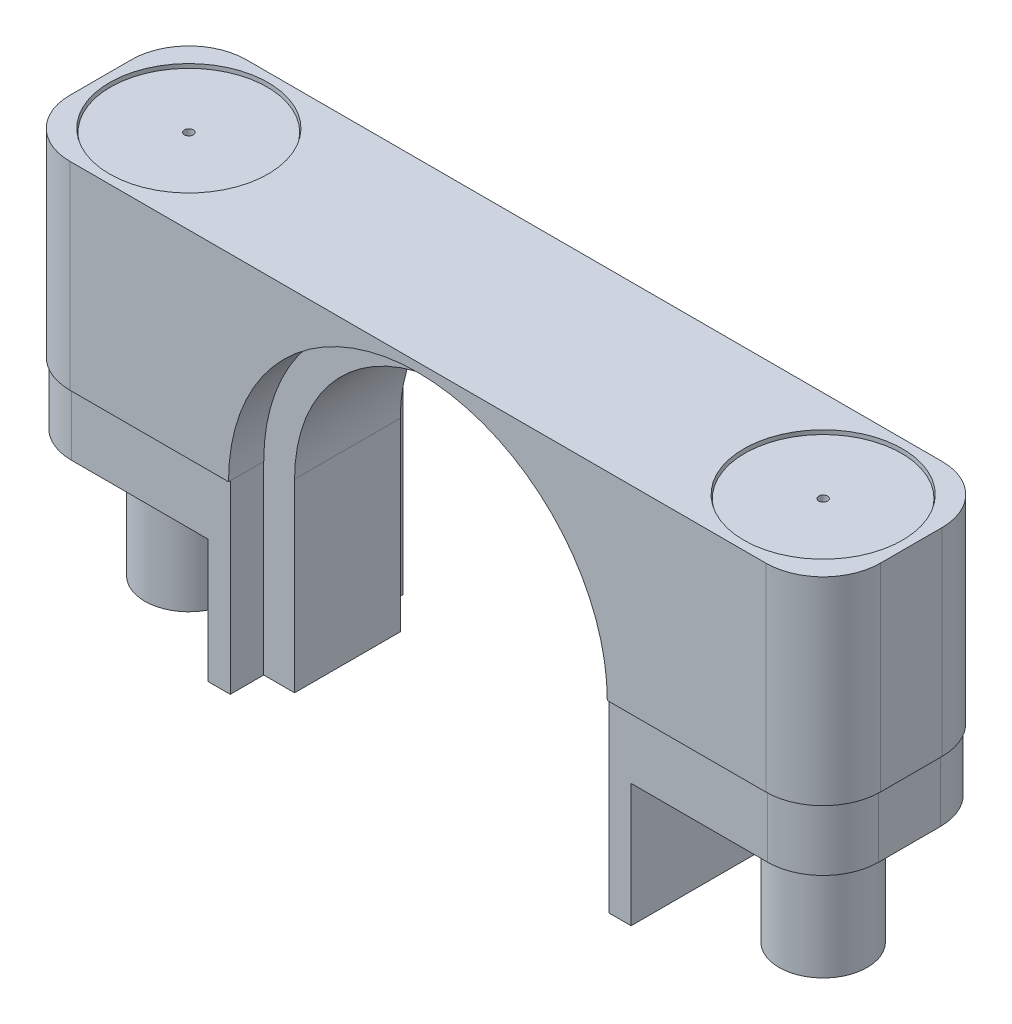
ISO-10303-21;
HEADER;
FILE_DESCRIPTION(('STEP AP214'),'2;1');
FILE_NAME('part.step','',(''),(''),'','','');
FILE_SCHEMA(('AUTOMOTIVE_DESIGN { 1 0 10303 214 1 1 1 1 }'));
ENDSEC;
DATA;
#1=APPLICATION_CONTEXT('core data for automotive mechanical design processes');
#2=APPLICATION_PROTOCOL_DEFINITION('international standard','automotive_design',2000,#1);
#3=PRODUCT_CONTEXT('',#1,'mechanical');
#4=PRODUCT('Part','Part','',(#3));
#5=PRODUCT_RELATED_PRODUCT_CATEGORY('part','',(#4));
#6=PRODUCT_DEFINITION_FORMATION('','',#4);
#7=PRODUCT_DEFINITION_CONTEXT('part definition',#1,'design');
#8=PRODUCT_DEFINITION('design','',#6,#7);
#9=PRODUCT_DEFINITION_SHAPE('','',#8);
#10=(LENGTH_UNIT() NAMED_UNIT(*) SI_UNIT(.MILLI.,.METRE.));
#11=(NAMED_UNIT(*) PLANE_ANGLE_UNIT() SI_UNIT($,.RADIAN.));
#12=(NAMED_UNIT(*) SI_UNIT($,.STERADIAN.) SOLID_ANGLE_UNIT());
#13=UNCERTAINTY_MEASURE_WITH_UNIT(LENGTH_MEASURE(1.E-05),#10,'distance_accuracy_value','');
#14=(GEOMETRIC_REPRESENTATION_CONTEXT(3) GLOBAL_UNCERTAINTY_ASSIGNED_CONTEXT((#13)) GLOBAL_UNIT_ASSIGNED_CONTEXT((#10,
#11,#12)) REPRESENTATION_CONTEXT('',''));
#15=CARTESIAN_POINT('',(0.,0.,0.));
#16=DIRECTION('',(0.,0.,1.));
#17=DIRECTION('',(1.,0.,0.));
#18=AXIS2_PLACEMENT_3D('',#15,#16,#17);
#19=CARTESIAN_POINT('',(36.,11.55,0.));
#20=DIRECTION('',(0.,1.,0.));
#21=DIRECTION('',(0.,0.,1.));
#22=AXIS2_PLACEMENT_3D('',#19,#20,#21);
#23=CYLINDRICAL_SURFACE('',#22,9.);
#24=CARTESIAN_POINT('',(36.,13.3623105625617,0.));
#25=DIRECTION('',(0.,-1.,0.));
#26=DIRECTION('',(0.,0.,-1.));
#27=AXIS2_PLACEMENT_3D('',#24,#25,#26);
#28=CIRCLE('',#27,9.);
#29=CARTESIAN_POINT('',(36.,13.3623105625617,-9.00000000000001));
#30=VERTEX_POINT('',#29);
#31=EDGE_CURVE('E429',#30,#30,#28,.T.);
#32=ORIENTED_EDGE('',*,*,#31,.T.);
#33=EDGE_LOOP('',(#32));
#34=FACE_BOUND('',#33,.T.);
#35=CARTESIAN_POINT('',(36.,14.75,0.));
#36=DIRECTION('',(0.,1.,0.));
#37=DIRECTION('',(0.,0.,1.));
#38=AXIS2_PLACEMENT_3D('',#35,#36,#37);
#39=CIRCLE('',#38,9.);
#40=CARTESIAN_POINT('',(36.,14.75,9.));
#41=VERTEX_POINT('',#40);
#42=EDGE_CURVE('E730',#41,#41,#39,.T.);
#43=ORIENTED_EDGE('',*,*,#42,.T.);
#44=EDGE_LOOP('',(#43));
#45=FACE_BOUND('',#44,.T.);
#46=ADVANCED_FACE('F18',(#34,#45),#23,.F.);
#47=CARTESIAN_POINT('',(-36.,11.55,0.));
#48=DIRECTION('',(0.,1.,0.));
#49=DIRECTION('',(0.,0.,1.));
#50=AXIS2_PLACEMENT_3D('',#47,#48,#49);
#51=CYLINDRICAL_SURFACE('',#50,9.);
#52=CARTESIAN_POINT('',(-36.,13.3623105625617,0.));
#53=DIRECTION('',(0.,-1.,0.));
#54=DIRECTION('',(0.,0.,-1.));
#55=AXIS2_PLACEMENT_3D('',#52,#53,#54);
#56=CIRCLE('',#55,9.);
#57=CARTESIAN_POINT('',(-36.,13.3623105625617,-9.00000000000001));
#58=VERTEX_POINT('',#57);
#59=EDGE_CURVE('E562',#58,#58,#56,.T.);
#60=ORIENTED_EDGE('',*,*,#59,.T.);
#61=EDGE_LOOP('',(#60));
#62=FACE_BOUND('',#61,.T.);
#63=CARTESIAN_POINT('',(-36.,14.75,0.));
#64=DIRECTION('',(0.,1.,0.));
#65=DIRECTION('',(0.,0.,1.));
#66=AXIS2_PLACEMENT_3D('',#63,#64,#65);
#67=CIRCLE('',#66,9.);
#68=CARTESIAN_POINT('',(-36.,14.75,9.));
#69=VERTEX_POINT('',#68);
#70=EDGE_CURVE('E742',#69,#69,#67,.T.);
#71=ORIENTED_EDGE('',*,*,#70,.T.);
#72=EDGE_LOOP('',(#71));
#73=FACE_BOUND('',#72,.T.);
#74=ADVANCED_FACE('F808',(#62,#73),#51,.F.);
#75=CARTESIAN_POINT('',(39.5,14.75,-3.5));
#76=DIRECTION('',(0.,-1.,0.));
#77=DIRECTION('',(0.,0.,-1.));
#78=AXIS2_PLACEMENT_3D('',#75,#76,#77);
#79=CYLINDRICAL_SURFACE('',#78,6.5);
#80=CARTESIAN_POINT('',(39.5,14.75,-3.5));
#81=DIRECTION('',(0.,1.,0.));
#82=DIRECTION('',(0.,0.,1.));
#83=AXIS2_PLACEMENT_3D('',#80,#81,#82);
#84=CIRCLE('',#83,6.5);
#85=CARTESIAN_POINT('',(46.,14.75,-3.5));
#86=VERTEX_POINT('',#85);
#87=CARTESIAN_POINT('',(39.5,14.75,-10.));
#88=VERTEX_POINT('',#87);
#89=EDGE_CURVE('E34',#86,#88,#84,.T.);
#90=ORIENTED_EDGE('',*,*,#89,.F.);
#91=DIRECTION('',(0.,-1.,0.));
#92=VECTOR('',#91,1.);
#93=CARTESIAN_POINT('',(46.,14.75,-3.5));
#94=LINE('',#93,#92);
#95=CARTESIAN_POINT('',(46.,-7.75,-3.5));
#96=VERTEX_POINT('',#95);
#97=EDGE_CURVE('E499',#86,#96,#94,.T.);
#98=ORIENTED_EDGE('',*,*,#97,.T.);
#99=CARTESIAN_POINT('',(39.5,-7.75,-3.5));
#100=DIRECTION('',(0.,-1.,0.));
#101=DIRECTION('',(0.,0.,-1.));
#102=AXIS2_PLACEMENT_3D('',#99,#100,#101);
#103=CIRCLE('',#102,6.5);
#104=CARTESIAN_POINT('',(39.5,-7.75,-10.));
#105=VERTEX_POINT('',#104);
#106=EDGE_CURVE('E494',#105,#96,#103,.T.);
#107=ORIENTED_EDGE('',*,*,#106,.F.);
#108=DIRECTION('',(0.,1.,0.));
#109=VECTOR('',#108,1.);
#110=CARTESIAN_POINT('',(39.5,0.,-10.));
#111=LINE('',#110,#109);
#112=EDGE_CURVE('E461',#105,#88,#111,.T.);
#113=ORIENTED_EDGE('',*,*,#112,.T.);
#114=EDGE_LOOP('',(#90,#98,#107,#113));
#115=FACE_BOUND('',#114,.T.);
#116=ADVANCED_FACE('F815',(#115),#79,.T.);
#117=CARTESIAN_POINT('',(46.,14.75,-10.));
#118=DIRECTION('',(1.,0.,0.));
#119=DIRECTION('',(0.,0.,-1.));
#120=AXIS2_PLACEMENT_3D('',#117,#118,#119);
#121=PLANE('',#120);
#122=DIRECTION('',(0.,0.,-1.));
#123=VECTOR('',#122,1.);
#124=CARTESIAN_POINT('',(46.,14.75,-10.));
#125=LINE('',#124,#123);
#126=CARTESIAN_POINT('',(46.,14.75,3.5));
#127=VERTEX_POINT('',#126);
#128=EDGE_CURVE('E765',#127,#86,#125,.T.);
#129=ORIENTED_EDGE('',*,*,#128,.F.);
#130=DIRECTION('',(0.,1.,0.));
#131=VECTOR('',#130,1.);
#132=CARTESIAN_POINT('',(46.,0.,3.5));
#133=LINE('',#132,#131);
#134=CARTESIAN_POINT('',(46.,-7.75,3.5));
#135=VERTEX_POINT('',#134);
#136=EDGE_CURVE('E501',#135,#127,#133,.T.);
#137=ORIENTED_EDGE('',*,*,#136,.F.);
#138=DIRECTION('',(0.,0.,-1.));
#139=VECTOR('',#138,1.);
#140=CARTESIAN_POINT('',(46.,-7.75,0.));
#141=LINE('',#140,#139);
#142=EDGE_CURVE('E492',#96,#135,#141,.F.);
#143=ORIENTED_EDGE('',*,*,#142,.F.);
#144=ORIENTED_EDGE('',*,*,#97,.F.);
#145=EDGE_LOOP('',(#129,#137,#143,#144));
#146=FACE_BOUND('',#145,.T.);
#147=ADVANCED_FACE('F20',(#146),#121,.T.);
#148=CARTESIAN_POINT('',(39.5,0.,3.5));
#149=DIRECTION('',(0.,1.,0.));
#150=DIRECTION('',(0.,0.,1.));
#151=AXIS2_PLACEMENT_3D('',#148,#149,#150);
#152=CYLINDRICAL_SURFACE('',#151,6.5);
#153=CARTESIAN_POINT('',(39.5,14.75,3.5));
#154=DIRECTION('',(0.,1.,0.));
#155=DIRECTION('',(0.,0.,1.));
#156=AXIS2_PLACEMENT_3D('',#153,#154,#155);
#157=CIRCLE('',#156,6.5);
#158=CARTESIAN_POINT('',(39.5,14.75,10.));
#159=VERTEX_POINT('',#158);
#160=EDGE_CURVE('E41',#159,#127,#157,.T.);
#161=ORIENTED_EDGE('',*,*,#160,.F.);
#162=DIRECTION('',(0.,1.,0.));
#163=VECTOR('',#162,1.);
#164=CARTESIAN_POINT('',(39.5,0.,10.));
#165=LINE('',#164,#163);
#166=CARTESIAN_POINT('',(39.5,-7.75,10.));
#167=VERTEX_POINT('',#166);
#168=EDGE_CURVE('E447',#167,#159,#165,.T.);
#169=ORIENTED_EDGE('',*,*,#168,.F.);
#170=CARTESIAN_POINT('',(39.5,-7.75,3.5));
#171=DIRECTION('',(0.,1.,0.));
#172=DIRECTION('',(0.,0.,1.));
#173=AXIS2_PLACEMENT_3D('',#170,#171,#172);
#174=CIRCLE('',#173,6.5);
#175=EDGE_CURVE('E483',#167,#135,#174,.T.);
#176=ORIENTED_EDGE('',*,*,#175,.T.);
#177=ORIENTED_EDGE('',*,*,#136,.T.);
#178=EDGE_LOOP('',(#161,#169,#176,#177));
#179=FACE_BOUND('',#178,.T.);
#180=ADVANCED_FACE('F875',(#179),#152,.T.);
#181=CARTESIAN_POINT('',(0.,0.,10.));
#182=DIRECTION('',(0.,0.,1.));
#183=DIRECTION('',(1.,0.,0.));
#184=AXIS2_PLACEMENT_3D('',#181,#182,#183);
#185=PLANE('',#184);
#186=DIRECTION('',(1.,0.,0.));
#187=VECTOR('',#186,1.);
#188=CARTESIAN_POINT('',(-46.,14.75,10.));
#189=LINE('',#188,#187);
#190=CARTESIAN_POINT('',(-39.5,14.75,10.));
#191=VERTEX_POINT('',#190);
#192=EDGE_CURVE('E762',#191,#159,#189,.T.);
#193=ORIENTED_EDGE('',*,*,#192,.F.);
#194=DIRECTION('',(0.,1.,0.));
#195=VECTOR('',#194,1.);
#196=CARTESIAN_POINT('',(-39.5,0.,10.));
#197=LINE('',#196,#195);
#198=CARTESIAN_POINT('',(-39.5,-7.75,10.));
#199=VERTEX_POINT('',#198);
#200=EDGE_CURVE('E445',#191,#199,#197,.F.);
#201=ORIENTED_EDGE('',*,*,#200,.T.);
#202=DIRECTION('',(1.,0.,0.));
#203=VECTOR('',#202,1.);
#204=CARTESIAN_POINT('',(0.,-7.75,10.));
#205=LINE('',#204,#203);
#206=CARTESIAN_POINT('',(-21.5,-7.75,10.));
#207=VERTEX_POINT('',#206);
#208=EDGE_CURVE('E442',#199,#207,#205,.T.);
#209=ORIENTED_EDGE('',*,*,#208,.T.);
#210=CARTESIAN_POINT('',(0.,-7.75,10.));
#211=DIRECTION('',(0.,0.,1.));
#212=DIRECTION('',(1.,0.,0.));
#213=AXIS2_PLACEMENT_3D('',#210,#211,#212);
#214=CIRCLE('',#213,21.5);
#215=CARTESIAN_POINT('',(21.5,-7.75,10.));
#216=VERTEX_POINT('',#215);
#217=EDGE_CURVE('E665',#216,#207,#214,.T.);
#218=ORIENTED_EDGE('',*,*,#217,.F.);
#219=DIRECTION('',(1.,0.,0.));
#220=VECTOR('',#219,1.);
#221=CARTESIAN_POINT('',(0.,-7.75,10.));
#222=LINE('',#221,#220);
#223=EDGE_CURVE('E448',#216,#167,#222,.T.);
#224=ORIENTED_EDGE('',*,*,#223,.T.);
#225=ORIENTED_EDGE('',*,*,#168,.T.);
#226=EDGE_LOOP('',(#193,#201,#209,#218,#224,#225));
#227=FACE_BOUND('',#226,.T.);
#228=ADVANCED_FACE('F872',(#227),#185,.T.);
#229=CARTESIAN_POINT('',(-39.5,0.,3.5));
#230=DIRECTION('',(0.,-1.,0.));
#231=DIRECTION('',(1.,0.,0.));
#232=AXIS2_PLACEMENT_3D('',#229,#230,#231);
#233=CYLINDRICAL_SURFACE('',#232,6.5);
#234=CARTESIAN_POINT('',(-39.5,14.75,3.5));
#235=DIRECTION('',(0.,1.,0.));
#236=DIRECTION('',(0.,0.,1.));
#237=AXIS2_PLACEMENT_3D('',#234,#235,#236);
#238=CIRCLE('',#237,6.5);
#239=CARTESIAN_POINT('',(-46.,14.75,3.5));
#240=VERTEX_POINT('',#239);
#241=EDGE_CURVE('E759',#240,#191,#238,.T.);
#242=ORIENTED_EDGE('',*,*,#241,.F.);
#243=DIRECTION('',(0.,-1.,0.));
#244=VECTOR('',#243,1.);
#245=CARTESIAN_POINT('',(-46.,0.,3.5));
#246=LINE('',#245,#244);
#247=CARTESIAN_POINT('',(-46.,-7.75,3.5));
#248=VERTEX_POINT('',#247);
#249=EDGE_CURVE('E480',#240,#248,#246,.T.);
#250=ORIENTED_EDGE('',*,*,#249,.T.);
#251=CARTESIAN_POINT('',(-39.5,-7.75,3.5));
#252=DIRECTION('',(0.,-1.,0.));
#253=DIRECTION('',(1.,0.,0.));
#254=AXIS2_PLACEMENT_3D('',#251,#252,#253);
#255=CIRCLE('',#254,6.5);
#256=EDGE_CURVE('E468',#199,#248,#255,.T.);
#257=ORIENTED_EDGE('',*,*,#256,.F.);
#258=ORIENTED_EDGE('',*,*,#200,.F.);
#259=EDGE_LOOP('',(#242,#250,#257,#258));
#260=FACE_BOUND('',#259,.T.);
#261=ADVANCED_FACE('F868',(#260),#233,.T.);
#262=CARTESIAN_POINT('',(-46.,14.75,-10.));
#263=DIRECTION('',(-1.,0.,0.));
#264=DIRECTION('',(0.,-1.,0.));
#265=AXIS2_PLACEMENT_3D('',#262,#263,#264);
#266=PLANE('',#265);
#267=DIRECTION('',(0.,0.,1.));
#268=VECTOR('',#267,1.);
#269=CARTESIAN_POINT('',(-46.,14.75,-10.));
#270=LINE('',#269,#268);
#271=CARTESIAN_POINT('',(-46.,14.75,-3.5));
#272=VERTEX_POINT('',#271);
#273=EDGE_CURVE('E756',#272,#240,#270,.T.);
#274=ORIENTED_EDGE('',*,*,#273,.F.);
#275=DIRECTION('',(0.,1.,0.));
#276=VECTOR('',#275,1.);
#277=CARTESIAN_POINT('',(-46.,14.75,-3.5));
#278=LINE('',#277,#276);
#279=CARTESIAN_POINT('',(-46.,-7.75,-3.5));
#280=VERTEX_POINT('',#279);
#281=EDGE_CURVE('E495',#280,#272,#278,.T.);
#282=ORIENTED_EDGE('',*,*,#281,.F.);
#283=DIRECTION('',(0.,0.,-1.));
#284=VECTOR('',#283,1.);
#285=CARTESIAN_POINT('',(-46.,-7.75,0.));
#286=LINE('',#285,#284);
#287=EDGE_CURVE('E464',#248,#280,#286,.T.);
#288=ORIENTED_EDGE('',*,*,#287,.F.);
#289=ORIENTED_EDGE('',*,*,#249,.F.);
#290=EDGE_LOOP('',(#274,#282,#288,#289));
#291=FACE_BOUND('',#290,.T.);
#292=ADVANCED_FACE('F864',(#291),#266,.T.);
#293=CARTESIAN_POINT('',(-39.5,14.75,-3.5));
#294=DIRECTION('',(0.,1.,0.));
#295=DIRECTION('',(-1.,0.,0.));
#296=AXIS2_PLACEMENT_3D('',#293,#294,#295);
#297=CYLINDRICAL_SURFACE('',#296,6.5);
#298=CARTESIAN_POINT('',(-39.5,14.75,-3.5));
#299=DIRECTION('',(0.,1.,0.));
#300=DIRECTION('',(0.,0.,1.));
#301=AXIS2_PLACEMENT_3D('',#298,#299,#300);
#302=CIRCLE('',#301,6.5);
#303=CARTESIAN_POINT('',(-39.5,14.75,-10.));
#304=VERTEX_POINT('',#303);
#305=EDGE_CURVE('E753',#304,#272,#302,.T.);
#306=ORIENTED_EDGE('',*,*,#305,.F.);
#307=DIRECTION('',(0.,1.,0.));
#308=VECTOR('',#307,1.);
#309=CARTESIAN_POINT('',(-39.5,0.,-10.));
#310=LINE('',#309,#308);
#311=CARTESIAN_POINT('',(-39.5,-7.75,-10.));
#312=VERTEX_POINT('',#311);
#313=EDGE_CURVE('E456',#304,#312,#310,.F.);
#314=ORIENTED_EDGE('',*,*,#313,.T.);
#315=CARTESIAN_POINT('',(-39.5,-7.75,-3.5));
#316=DIRECTION('',(0.,1.,0.));
#317=DIRECTION('',(-1.,0.,0.));
#318=AXIS2_PLACEMENT_3D('',#315,#316,#317);
#319=CIRCLE('',#318,6.5);
#320=EDGE_CURVE('E467',#280,#312,#319,.F.);
#321=ORIENTED_EDGE('',*,*,#320,.F.);
#322=ORIENTED_EDGE('',*,*,#281,.T.);
#323=EDGE_LOOP('',(#306,#314,#321,#322));
#324=FACE_BOUND('',#323,.T.);
#325=ADVANCED_FACE('F860',(#324),#297,.T.);
#326=CARTESIAN_POINT('',(0.,0.,-10.));
#327=DIRECTION('',(0.,0.,1.));
#328=DIRECTION('',(1.,0.,0.));
#329=AXIS2_PLACEMENT_3D('',#326,#327,#328);
#330=PLANE('',#329);
#331=ORIENTED_EDGE('',*,*,#313,.F.);
#332=DIRECTION('',(1.,0.,0.));
#333=VECTOR('',#332,1.);
#334=CARTESIAN_POINT('',(-46.,14.75,-10.));
#335=LINE('',#334,#333);
#336=EDGE_CURVE('E751',#304,#88,#335,.T.);
#337=ORIENTED_EDGE('',*,*,#336,.T.);
#338=ORIENTED_EDGE('',*,*,#112,.F.);
#339=DIRECTION('',(1.,0.,0.));
#340=VECTOR('',#339,1.);
#341=CARTESIAN_POINT('',(0.,-7.75,-10.));
#342=LINE('',#341,#340);
#343=CARTESIAN_POINT('',(21.5,-7.75,-10.));
#344=VERTEX_POINT('',#343);
#345=EDGE_CURVE('E458',#344,#105,#342,.T.);
#346=ORIENTED_EDGE('',*,*,#345,.F.);
#347=CARTESIAN_POINT('',(0.,-7.75,-10.));
#348=DIRECTION('',(0.,0.,1.));
#349=DIRECTION('',(1.,0.,0.));
#350=AXIS2_PLACEMENT_3D('',#347,#348,#349);
#351=CIRCLE('',#350,21.5);
#352=CARTESIAN_POINT('',(-21.5,-7.75,-10.));
#353=VERTEX_POINT('',#352);
#354=EDGE_CURVE('E656',#353,#344,#351,.F.);
#355=ORIENTED_EDGE('',*,*,#354,.F.);
#356=DIRECTION('',(1.,0.,0.));
#357=VECTOR('',#356,1.);
#358=CARTESIAN_POINT('',(0.,-7.75,-10.));
#359=LINE('',#358,#357);
#360=EDGE_CURVE('E454',#312,#353,#359,.T.);
#361=ORIENTED_EDGE('',*,*,#360,.F.);
#362=EDGE_LOOP('',(#331,#337,#338,#346,#355,#361));
#363=FACE_BOUND('',#362,.T.);
#364=ADVANCED_FACE('F856',(#363),#330,.F.);
#365=CARTESIAN_POINT('',(0.,-28.75,0.));
#366=DIRECTION('',(0.,-1.,0.));
#367=DIRECTION('',(0.,0.,-1.));
#368=AXIS2_PLACEMENT_3D('',#365,#366,#367);
#369=PLANE('',#368);
#370=DIRECTION('',(0.,0.,1.));
#371=VECTOR('',#370,1.);
#372=CARTESIAN_POINT('',(21.5,-28.75,0.));
#373=LINE('',#372,#371);
#374=CARTESIAN_POINT('',(21.5,-28.75,-9.8));
#375=VERTEX_POINT('',#374);
#376=CARTESIAN_POINT('',(21.5,-28.75,-6.));
#377=VERTEX_POINT('',#376);
#378=EDGE_CURVE('E629',#375,#377,#373,.T.);
#379=ORIENTED_EDGE('',*,*,#378,.F.);
#380=DIRECTION('',(1.,0.,0.));
#381=VECTOR('',#380,1.);
#382=CARTESIAN_POINT('',(0.,-28.75,-9.8));
#383=LINE('',#382,#381);
#384=CARTESIAN_POINT('',(24.,-28.75,-9.8));
#385=VERTEX_POINT('',#384);
#386=EDGE_CURVE('E612',#375,#385,#383,.T.);
#387=ORIENTED_EDGE('',*,*,#386,.T.);
#388=DIRECTION('',(0.,0.,-1.));
#389=VECTOR('',#388,1.);
#390=CARTESIAN_POINT('',(24.,-28.75,0.));
#391=LINE('',#390,#389);
#392=CARTESIAN_POINT('',(24.,-28.75,9.8));
#393=VERTEX_POINT('',#392);
#394=EDGE_CURVE('E615',#393,#385,#391,.T.);
#395=ORIENTED_EDGE('',*,*,#394,.F.);
#396=DIRECTION('',(-1.,0.,0.));
#397=VECTOR('',#396,1.);
#398=CARTESIAN_POINT('',(0.,-28.75,9.8));
#399=LINE('',#398,#397);
#400=CARTESIAN_POINT('',(21.5,-28.75,9.8));
#401=VERTEX_POINT('',#400);
#402=EDGE_CURVE('E617',#393,#401,#399,.T.);
#403=ORIENTED_EDGE('',*,*,#402,.T.);
#404=DIRECTION('',(0.,0.,1.));
#405=VECTOR('',#404,1.);
#406=CARTESIAN_POINT('',(21.5,-28.75,0.));
#407=LINE('',#406,#405);
#408=CARTESIAN_POINT('',(21.5,-28.75,6.));
#409=VERTEX_POINT('',#408);
#410=EDGE_CURVE('E619',#409,#401,#407,.T.);
#411=ORIENTED_EDGE('',*,*,#410,.F.);
#412=DIRECTION('',(-1.,0.,0.));
#413=VECTOR('',#412,1.);
#414=CARTESIAN_POINT('',(0.,-28.75,6.));
#415=LINE('',#414,#413);
#416=CARTESIAN_POINT('',(18.,-28.75,6.));
#417=VERTEX_POINT('',#416);
#418=EDGE_CURVE('E622',#409,#417,#415,.T.);
#419=ORIENTED_EDGE('',*,*,#418,.T.);
#420=DIRECTION('',(0.,0.,1.));
#421=VECTOR('',#420,1.);
#422=CARTESIAN_POINT('',(18.,-28.75,0.));
#423=LINE('',#422,#421);
#424=CARTESIAN_POINT('',(18.,-28.75,-6.));
#425=VERTEX_POINT('',#424);
#426=EDGE_CURVE('E624',#425,#417,#423,.T.);
#427=ORIENTED_EDGE('',*,*,#426,.F.);
#428=DIRECTION('',(1.,0.,0.));
#429=VECTOR('',#428,1.);
#430=CARTESIAN_POINT('',(0.,-28.75,-6.));
#431=LINE('',#430,#429);
#432=EDGE_CURVE('E627',#425,#377,#431,.T.);
#433=ORIENTED_EDGE('',*,*,#432,.T.);
#434=EDGE_LOOP('',(#379,#387,#395,#403,#411,#419,#427,#433));
#435=FACE_BOUND('',#434,.T.);
#436=ADVANCED_FACE('F859',(#435),#369,.T.);
#437=DIRECTION('',(0.,0.,1.));
#438=VECTOR('',#437,1.);
#439=CARTESIAN_POINT('',(-24.,-28.75,0.));
#440=LINE('',#439,#438);
#441=CARTESIAN_POINT('',(-24.,-28.75,-9.8));
#442=VERTEX_POINT('',#441);
#443=CARTESIAN_POINT('',(-24.,-28.75,9.8));
#444=VERTEX_POINT('',#443);
#445=EDGE_CURVE('E609',#442,#444,#440,.T.);
#446=ORIENTED_EDGE('',*,*,#445,.F.);
#447=DIRECTION('',(1.,0.,0.));
#448=VECTOR('',#447,1.);
#449=CARTESIAN_POINT('',(0.,-28.75,-9.8));
#450=LINE('',#449,#448);
#451=CARTESIAN_POINT('',(-21.5,-28.75,-9.8));
#452=VERTEX_POINT('',#451);
#453=EDGE_CURVE('E597',#442,#452,#450,.T.);
#454=ORIENTED_EDGE('',*,*,#453,.T.);
#455=DIRECTION('',(0.,0.,-1.));
#456=VECTOR('',#455,1.);
#457=CARTESIAN_POINT('',(-21.5,-28.75,0.));
#458=LINE('',#457,#456);
#459=CARTESIAN_POINT('',(-21.5,-28.75,-6.));
#460=VERTEX_POINT('',#459);
#461=EDGE_CURVE('E600',#460,#452,#458,.T.);
#462=ORIENTED_EDGE('',*,*,#461,.F.);
#463=DIRECTION('',(1.,0.,0.));
#464=VECTOR('',#463,1.);
#465=CARTESIAN_POINT('',(0.,-28.75,-6.));
#466=LINE('',#465,#464);
#467=CARTESIAN_POINT('',(-18.,-28.75,-6.));
#468=VERTEX_POINT('',#467);
#469=EDGE_CURVE('E595',#460,#468,#466,.T.);
#470=ORIENTED_EDGE('',*,*,#469,.T.);
#471=DIRECTION('',(0.,0.,-1.));
#472=VECTOR('',#471,1.);
#473=CARTESIAN_POINT('',(-18.,-28.75,0.));
#474=LINE('',#473,#472);
#475=CARTESIAN_POINT('',(-18.,-28.75,6.));
#476=VERTEX_POINT('',#475);
#477=EDGE_CURVE('E602',#476,#468,#474,.T.);
#478=ORIENTED_EDGE('',*,*,#477,.F.);
#479=DIRECTION('',(-1.,0.,0.));
#480=VECTOR('',#479,1.);
#481=CARTESIAN_POINT('',(0.,-28.75,6.));
#482=LINE('',#481,#480);
#483=CARTESIAN_POINT('',(-21.5,-28.75,6.));
#484=VERTEX_POINT('',#483);
#485=EDGE_CURVE('E444',#476,#484,#482,.T.);
#486=ORIENTED_EDGE('',*,*,#485,.T.);
#487=DIRECTION('',(0.,0.,-1.));
#488=VECTOR('',#487,1.);
#489=CARTESIAN_POINT('',(-21.5,-28.75,0.));
#490=LINE('',#489,#488);
#491=CARTESIAN_POINT('',(-21.5,-28.75,9.8));
#492=VERTEX_POINT('',#491);
#493=EDGE_CURVE('E605',#492,#484,#490,.T.);
#494=ORIENTED_EDGE('',*,*,#493,.F.);
#495=DIRECTION('',(-1.,0.,0.));
#496=VECTOR('',#495,1.);
#497=CARTESIAN_POINT('',(0.,-28.75,9.8));
#498=LINE('',#497,#496);
#499=EDGE_CURVE('E607',#492,#444,#498,.T.);
#500=ORIENTED_EDGE('',*,*,#499,.T.);
#501=EDGE_LOOP('',(#446,#454,#462,#470,#478,#486,#494,#500));
#502=FACE_BOUND('',#501,.T.);
#503=ADVANCED_FACE('F853',(#502),#369,.T.);
#504=CARTESIAN_POINT('',(-18.,-31.9367875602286,10.));
#505=DIRECTION('',(-1.,0.,0.));
#506=DIRECTION('',(0.,0.,1.));
#507=AXIS2_PLACEMENT_3D('',#504,#505,#506);
#508=PLANE('',#507);
#509=DIRECTION('',(0.,0.,-1.));
#510=VECTOR('',#509,1.);
#511=CARTESIAN_POINT('',(-18.,-7.75,10.));
#512=LINE('',#511,#510);
#513=CARTESIAN_POINT('',(-18.,-7.75,-6.));
#514=VERTEX_POINT('',#513);
#515=CARTESIAN_POINT('',(-18.,-7.75,6.));
#516=VERTEX_POINT('',#515);
#517=EDGE_CURVE('E560',#514,#516,#512,.F.);
#518=ORIENTED_EDGE('',*,*,#517,.T.);
#519=DIRECTION('',(0.,1.,0.));
#520=VECTOR('',#519,1.);
#521=CARTESIAN_POINT('',(-18.,-31.9367875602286,6.));
#522=LINE('',#521,#520);
#523=EDGE_CURVE('E635',#476,#516,#522,.T.);
#524=ORIENTED_EDGE('',*,*,#523,.F.);
#525=ORIENTED_EDGE('',*,*,#477,.T.);
#526=DIRECTION('',(0.,1.,0.));
#527=VECTOR('',#526,1.);
#528=CARTESIAN_POINT('',(-18.,-33.5295457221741,-6.));
#529=LINE('',#528,#527);
#530=EDGE_CURVE('E641',#468,#514,#529,.T.);
#531=ORIENTED_EDGE('',*,*,#530,.T.);
#532=EDGE_LOOP('',(#518,#524,#525,#531));
#533=FACE_BOUND('',#532,.T.);
#534=ADVANCED_FACE('F1025',(#533),#508,.F.);
#535=CARTESIAN_POINT('',(0.,-7.75,10.));
#536=DIRECTION('',(0.,0.,-1.));
#537=DIRECTION('',(-1.,0.,0.));
#538=AXIS2_PLACEMENT_3D('',#535,#536,#537);
#539=CYLINDRICAL_SURFACE('',#538,18.);
#540=ORIENTED_EDGE('',*,*,#517,.F.);
#541=CARTESIAN_POINT('',(0.,-7.75,-6.));
#542=DIRECTION('',(0.,0.,-1.));
#543=DIRECTION('',(-1.,0.,0.));
#544=AXIS2_PLACEMENT_3D('',#541,#542,#543);
#545=CIRCLE('',#544,18.);
#546=CARTESIAN_POINT('',(18.,-7.75,-6.));
#547=VERTEX_POINT('',#546);
#548=EDGE_CURVE('E647',#514,#547,#545,.T.);
#549=ORIENTED_EDGE('',*,*,#548,.T.);
#550=DIRECTION('',(0.,0.,-1.));
#551=VECTOR('',#550,1.);
#552=CARTESIAN_POINT('',(18.,-7.75,10.));
#553=LINE('',#552,#551);
#554=CARTESIAN_POINT('',(18.,-7.75,6.));
#555=VERTEX_POINT('',#554);
#556=EDGE_CURVE('E558',#547,#555,#553,.F.);
#557=ORIENTED_EDGE('',*,*,#556,.T.);
#558=CARTESIAN_POINT('',(0.,-7.75,6.));
#559=DIRECTION('',(0.,0.,1.));
#560=DIRECTION('',(1.,0.,0.));
#561=AXIS2_PLACEMENT_3D('',#558,#559,#560);
#562=CIRCLE('',#561,18.);
#563=EDGE_CURVE('E638',#555,#516,#562,.T.);
#564=ORIENTED_EDGE('',*,*,#563,.T.);
#565=EDGE_LOOP('',(#540,#549,#557,#564));
#566=FACE_BOUND('',#565,.T.);
#567=ADVANCED_FACE('F1035',(#566),#539,.F.);
#568=CARTESIAN_POINT('',(18.,-31.9367875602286,10.));
#569=DIRECTION('',(1.,0.,0.));
#570=DIRECTION('',(0.,0.,-1.));
#571=AXIS2_PLACEMENT_3D('',#568,#569,#570);
#572=PLANE('',#571);
#573=ORIENTED_EDGE('',*,*,#556,.F.);
#574=DIRECTION('',(0.,1.,0.));
#575=VECTOR('',#574,1.);
#576=CARTESIAN_POINT('',(18.,-31.9367875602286,-6.));
#577=LINE('',#576,#575);
#578=EDGE_CURVE('E644',#425,#547,#577,.T.);
#579=ORIENTED_EDGE('',*,*,#578,.F.);
#580=ORIENTED_EDGE('',*,*,#426,.T.);
#581=DIRECTION('',(0.,1.,0.));
#582=VECTOR('',#581,1.);
#583=CARTESIAN_POINT('',(18.,-33.7022472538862,6.));
#584=LINE('',#583,#582);
#585=EDGE_CURVE('E632',#417,#555,#584,.T.);
#586=ORIENTED_EDGE('',*,*,#585,.T.);
#587=EDGE_LOOP('',(#573,#579,#580,#586));
#588=FACE_BOUND('',#587,.T.);
#589=ADVANCED_FACE('F1038',(#588),#572,.F.);
#590=CARTESIAN_POINT('',(24.,-28.75,10.));
#591=DIRECTION('',(-1.,0.,0.));
#592=DIRECTION('',(0.,0.,1.));
#593=AXIS2_PLACEMENT_3D('',#590,#591,#592);
#594=PLANE('',#593);
#595=DIRECTION('',(0.,0.,-1.));
#596=VECTOR('',#595,1.);
#597=CARTESIAN_POINT('',(24.,-14.75,-10.));
#598=LINE('',#597,#596);
#599=CARTESIAN_POINT('',(24.,-14.75,9.8));
#600=VERTEX_POINT('',#599);
#601=CARTESIAN_POINT('',(24.,-14.75,-9.8));
#602=VERTEX_POINT('',#601);
#603=EDGE_CURVE('E556',#600,#602,#598,.T.);
#604=ORIENTED_EDGE('',*,*,#603,.F.);
#605=DIRECTION('',(0.,1.,0.));
#606=VECTOR('',#605,1.);
#607=CARTESIAN_POINT('',(24.,-28.75,9.8));
#608=LINE('',#607,#606);
#609=EDGE_CURVE('E689',#393,#600,#608,.T.);
#610=ORIENTED_EDGE('',*,*,#609,.F.);
#611=ORIENTED_EDGE('',*,*,#394,.T.);
#612=DIRECTION('',(0.,-1.,0.));
#613=VECTOR('',#612,1.);
#614=CARTESIAN_POINT('',(24.,-28.75,-9.8));
#615=LINE('',#614,#613);
#616=EDGE_CURVE('E668',#602,#385,#615,.T.);
#617=ORIENTED_EDGE('',*,*,#616,.F.);
#618=EDGE_LOOP('',(#604,#610,#611,#617));
#619=FACE_BOUND('',#618,.T.);
#620=ADVANCED_FACE('F1033',(#619),#594,.F.);
#621=CARTESIAN_POINT('',(-46.,-14.75,-10.));
#622=DIRECTION('',(0.,-1.,0.));
#623=DIRECTION('',(0.,0.,-1.));
#624=AXIS2_PLACEMENT_3D('',#621,#622,#623);
#625=PLANE('',#624);
#626=CARTESIAN_POINT('',(36.,-14.75,0.));
#627=DIRECTION('',(0.,-1.,0.));
#628=DIRECTION('',(0.,0.,-1.));
#629=AXIS2_PLACEMENT_3D('',#626,#627,#628);
#630=CIRCLE('',#629,5.5);
#631=CARTESIAN_POINT('',(36.,-14.75,-5.5));
#632=VERTEX_POINT('',#631);
#633=EDGE_CURVE('E748',#632,#632,#630,.T.);
#634=ORIENTED_EDGE('',*,*,#633,.F.);
#635=EDGE_LOOP('',(#634));
#636=FACE_BOUND('',#635,.T.);
#637=DIRECTION('',(-1.,0.,0.));
#638=VECTOR('',#637,1.);
#639=CARTESIAN_POINT('',(-46.,-14.75,9.8));
#640=LINE('',#639,#638);
#641=CARTESIAN_POINT('',(39.5,-14.75,9.8));
#642=VERTEX_POINT('',#641);
#643=EDGE_CURVE('E711',#600,#642,#640,.F.);
#644=ORIENTED_EDGE('',*,*,#643,.F.);
#645=ORIENTED_EDGE('',*,*,#603,.T.);
#646=DIRECTION('',(-1.,0.,0.));
#647=VECTOR('',#646,1.);
#648=CARTESIAN_POINT('',(39.5,-14.75,-9.8));
#649=LINE('',#648,#647);
#650=CARTESIAN_POINT('',(39.5,-14.75,-9.8));
#651=VERTEX_POINT('',#650);
#652=EDGE_CURVE('E724',#602,#651,#649,.F.);
#653=ORIENTED_EDGE('',*,*,#652,.T.);
#654=CARTESIAN_POINT('',(39.5,-14.75,-3.5));
#655=DIRECTION('',(0.,-1.,0.));
#656=DIRECTION('',(0.,0.,-1.));
#657=AXIS2_PLACEMENT_3D('',#654,#655,#656);
#658=CIRCLE('',#657,6.3);
#659=CARTESIAN_POINT('',(45.8,-14.75,-3.5));
#660=VERTEX_POINT('',#659);
#661=EDGE_CURVE('E727',#660,#651,#658,.F.);
#662=ORIENTED_EDGE('',*,*,#661,.F.);
#663=DIRECTION('',(0.,0.,1.));
#664=VECTOR('',#663,1.);
#665=CARTESIAN_POINT('',(45.8,-14.75,-10.));
#666=LINE('',#665,#664);
#667=CARTESIAN_POINT('',(45.8,-14.75,3.5));
#668=VERTEX_POINT('',#667);
#669=EDGE_CURVE('E719',#668,#660,#666,.F.);
#670=ORIENTED_EDGE('',*,*,#669,.F.);
#671=CARTESIAN_POINT('',(39.5,-14.75,3.5));
#672=DIRECTION('',(0.,-1.,0.));
#673=DIRECTION('',(0.,0.,-1.));
#674=AXIS2_PLACEMENT_3D('',#671,#672,#673);
#675=CIRCLE('',#674,6.3);
#676=EDGE_CURVE('E716',#642,#668,#675,.F.);
#677=ORIENTED_EDGE('',*,*,#676,.F.);
#678=EDGE_LOOP('',(#644,#645,#653,#662,#670,#677));
#679=FACE_BOUND('',#678,.T.);
#680=ADVANCED_FACE('F1030',(#636,#679),#625,.T.);
#681=CARTESIAN_POINT('',(-24.,-28.75,10.));
#682=DIRECTION('',(1.,0.,0.));
#683=DIRECTION('',(0.,0.,-1.));
#684=AXIS2_PLACEMENT_3D('',#681,#682,#683);
#685=PLANE('',#684);
#686=DIRECTION('',(0.,0.,-1.));
#687=VECTOR('',#686,1.);
#688=CARTESIAN_POINT('',(-24.,-14.75,-10.));
#689=LINE('',#688,#687);
#690=CARTESIAN_POINT('',(-24.,-14.75,-9.8));
#691=VERTEX_POINT('',#690);
#692=CARTESIAN_POINT('',(-24.,-14.75,9.8));
#693=VERTEX_POINT('',#692);
#694=EDGE_CURVE('E551',#691,#693,#689,.F.);
#695=ORIENTED_EDGE('',*,*,#694,.F.);
#696=DIRECTION('',(0.,-1.,0.));
#697=VECTOR('',#696,1.);
#698=CARTESIAN_POINT('',(-24.,87.3403065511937,-9.8));
#699=LINE('',#698,#697);
#700=EDGE_CURVE('E677',#691,#442,#699,.T.);
#701=ORIENTED_EDGE('',*,*,#700,.T.);
#702=ORIENTED_EDGE('',*,*,#445,.T.);
#703=DIRECTION('',(0.,1.,0.));
#704=VECTOR('',#703,1.);
#705=CARTESIAN_POINT('',(-24.,87.3403065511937,9.8));
#706=LINE('',#705,#704);
#707=EDGE_CURVE('E680',#444,#693,#706,.T.);
#708=ORIENTED_EDGE('',*,*,#707,.T.);
#709=EDGE_LOOP('',(#695,#701,#702,#708));
#710=FACE_BOUND('',#709,.T.);
#711=ADVANCED_FACE('F973',(#710),#685,.F.);
#712=CARTESIAN_POINT('',(-46.,-14.75,-10.));
#713=DIRECTION('',(0.,-1.,0.));
#714=DIRECTION('',(0.,0.,-1.));
#715=AXIS2_PLACEMENT_3D('',#712,#713,#714);
#716=PLANE('',#715);
#717=CARTESIAN_POINT('',(-36.,-14.75,0.));
#718=DIRECTION('',(0.,-1.,0.));
#719=DIRECTION('',(0.,0.,-1.));
#720=AXIS2_PLACEMENT_3D('',#717,#718,#719);
#721=CIRCLE('',#720,5.5);
#722=CARTESIAN_POINT('',(-36.,-14.75,-5.5));
#723=VERTEX_POINT('',#722);
#724=EDGE_CURVE('E745',#723,#723,#721,.T.);
#725=ORIENTED_EDGE('',*,*,#724,.F.);
#726=EDGE_LOOP('',(#725));
#727=FACE_BOUND('',#726,.T.);
#728=DIRECTION('',(1.,0.,0.));
#729=VECTOR('',#728,1.);
#730=CARTESIAN_POINT('',(-46.,-14.75,-9.8));
#731=LINE('',#730,#729);
#732=CARTESIAN_POINT('',(-39.5,-14.75,-9.8));
#733=VERTEX_POINT('',#732);
#734=EDGE_CURVE('E692',#691,#733,#731,.F.);
#735=ORIENTED_EDGE('',*,*,#734,.F.);
#736=ORIENTED_EDGE('',*,*,#694,.T.);
#737=DIRECTION('',(1.,0.,0.));
#738=VECTOR('',#737,1.);
#739=CARTESIAN_POINT('',(23.7,-14.75,9.8));
#740=LINE('',#739,#738);
#741=CARTESIAN_POINT('',(-39.5,-14.75,9.8));
#742=VERTEX_POINT('',#741);
#743=EDGE_CURVE('E695',#693,#742,#740,.F.);
#744=ORIENTED_EDGE('',*,*,#743,.T.);
#745=CARTESIAN_POINT('',(-39.5,-14.75,3.5));
#746=DIRECTION('',(0.,-1.,0.));
#747=DIRECTION('',(0.,0.,-1.));
#748=AXIS2_PLACEMENT_3D('',#745,#746,#747);
#749=CIRCLE('',#748,6.3);
#750=CARTESIAN_POINT('',(-45.8,-14.75,3.5));
#751=VERTEX_POINT('',#750);
#752=EDGE_CURVE('E698',#742,#751,#749,.T.);
#753=ORIENTED_EDGE('',*,*,#752,.T.);
#754=DIRECTION('',(0.,0.,1.));
#755=VECTOR('',#754,1.);
#756=CARTESIAN_POINT('',(-45.8,-14.75,3.5));
#757=LINE('',#756,#755);
#758=CARTESIAN_POINT('',(-45.8,-14.75,-3.5));
#759=VERTEX_POINT('',#758);
#760=EDGE_CURVE('E701',#751,#759,#757,.F.);
#761=ORIENTED_EDGE('',*,*,#760,.T.);
#762=CARTESIAN_POINT('',(-39.5,-14.75,-3.5));
#763=DIRECTION('',(0.,-1.,0.));
#764=DIRECTION('',(0.,0.,-1.));
#765=AXIS2_PLACEMENT_3D('',#762,#763,#764);
#766=CIRCLE('',#765,6.3);
#767=EDGE_CURVE('E706',#733,#759,#766,.F.);
#768=ORIENTED_EDGE('',*,*,#767,.F.);
#769=EDGE_LOOP('',(#735,#736,#744,#753,#761,#768));
#770=FACE_BOUND('',#769,.T.);
#771=ADVANCED_FACE('F977',(#727,#770),#716,.T.);
#772=CARTESIAN_POINT('',(0.,-33.5295457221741,-6.));
#773=DIRECTION('',(0.,0.,-1.));
#774=DIRECTION('',(-1.,0.,0.));
#775=AXIS2_PLACEMENT_3D('',#772,#773,#774);
#776=PLANE('',#775);
#777=ORIENTED_EDGE('',*,*,#530,.F.);
#778=ORIENTED_EDGE('',*,*,#469,.F.);
#779=DIRECTION('',(0.,1.,0.));
#780=VECTOR('',#779,1.);
#781=CARTESIAN_POINT('',(-21.5,-33.5295457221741,-6.));
#782=LINE('',#781,#780);
#783=CARTESIAN_POINT('',(-21.5,-7.75,-6.));
#784=VERTEX_POINT('',#783);
#785=EDGE_CURVE('E541',#460,#784,#782,.T.);
#786=ORIENTED_EDGE('',*,*,#785,.T.);
#787=CARTESIAN_POINT('',(0.,-7.75,-6.));
#788=DIRECTION('',(0.,0.,-1.));
#789=DIRECTION('',(-1.,0.,0.));
#790=AXIS2_PLACEMENT_3D('',#787,#788,#789);
#791=CIRCLE('',#790,21.5);
#792=CARTESIAN_POINT('',(21.5,-7.75,-6.));
#793=VERTEX_POINT('',#792);
#794=EDGE_CURVE('E554',#784,#793,#791,.T.);
#795=ORIENTED_EDGE('',*,*,#794,.T.);
#796=DIRECTION('',(0.,1.,0.));
#797=VECTOR('',#796,1.);
#798=CARTESIAN_POINT('',(21.5,-33.5295457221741,-6.));
#799=LINE('',#798,#797);
#800=EDGE_CURVE('E548',#793,#377,#799,.F.);
#801=ORIENTED_EDGE('',*,*,#800,.T.);
#802=ORIENTED_EDGE('',*,*,#432,.F.);
#803=ORIENTED_EDGE('',*,*,#578,.T.);
#804=ORIENTED_EDGE('',*,*,#548,.F.);
#805=EDGE_LOOP('',(#777,#778,#786,#795,#801,#802,#803,#804));
#806=FACE_BOUND('',#805,.T.);
#807=ADVANCED_FACE('F1028',(#806),#776,.T.);
#808=CARTESIAN_POINT('',(21.5,-33.5295457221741,-6.));
#809=DIRECTION('',(1.,0.,0.));
#810=DIRECTION('',(0.,0.,-1.));
#811=AXIS2_PLACEMENT_3D('',#808,#809,#810);
#812=PLANE('',#811);
#813=DIRECTION('',(0.,0.,-1.));
#814=VECTOR('',#813,1.);
#815=CARTESIAN_POINT('',(21.5,-7.75,-6.));
#816=LINE('',#815,#814);
#817=CARTESIAN_POINT('',(21.5,-7.75,-9.8));
#818=VERTEX_POINT('',#817);
#819=EDGE_CURVE('E546',#793,#818,#816,.T.);
#820=ORIENTED_EDGE('',*,*,#819,.T.);
#821=DIRECTION('',(0.,-1.,0.));
#822=VECTOR('',#821,1.);
#823=CARTESIAN_POINT('',(21.5,87.3403065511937,-9.8));
#824=LINE('',#823,#822);
#825=EDGE_CURVE('E671',#818,#375,#824,.T.);
#826=ORIENTED_EDGE('',*,*,#825,.T.);
#827=ORIENTED_EDGE('',*,*,#378,.T.);
#828=ORIENTED_EDGE('',*,*,#800,.F.);
#829=EDGE_LOOP('',(#820,#826,#827,#828));
#830=FACE_BOUND('',#829,.T.);
#831=ADVANCED_FACE('F953',(#830),#812,.F.);
#832=CARTESIAN_POINT('',(-21.5,-33.5295457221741,-6.));
#833=DIRECTION('',(-1.,0.,0.));
#834=DIRECTION('',(0.,0.,1.));
#835=AXIS2_PLACEMENT_3D('',#832,#833,#834);
#836=PLANE('',#835);
#837=ORIENTED_EDGE('',*,*,#785,.F.);
#838=ORIENTED_EDGE('',*,*,#461,.T.);
#839=DIRECTION('',(0.,-1.,0.));
#840=VECTOR('',#839,1.);
#841=CARTESIAN_POINT('',(-21.5,-33.5295457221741,-9.8));
#842=LINE('',#841,#840);
#843=CARTESIAN_POINT('',(-21.5,-7.75,-9.8));
#844=VERTEX_POINT('',#843);
#845=EDGE_CURVE('E686',#844,#452,#842,.T.);
#846=ORIENTED_EDGE('',*,*,#845,.F.);
#847=DIRECTION('',(0.,0.,-1.));
#848=VECTOR('',#847,1.);
#849=CARTESIAN_POINT('',(-21.5,-7.75,-6.));
#850=LINE('',#849,#848);
#851=EDGE_CURVE('E543',#844,#784,#850,.F.);
#852=ORIENTED_EDGE('',*,*,#851,.T.);
#853=EDGE_LOOP('',(#837,#838,#846,#852));
#854=FACE_BOUND('',#853,.T.);
#855=ADVANCED_FACE('F967',(#854),#836,.F.);
#856=CARTESIAN_POINT('',(0.,-33.7022472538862,6.));
#857=DIRECTION('',(0.,0.,1.));
#858=DIRECTION('',(1.,0.,0.));
#859=AXIS2_PLACEMENT_3D('',#856,#857,#858);
#860=PLANE('',#859);
#861=ORIENTED_EDGE('',*,*,#585,.F.);
#862=ORIENTED_EDGE('',*,*,#418,.F.);
#863=DIRECTION('',(0.,1.,0.));
#864=VECTOR('',#863,1.);
#865=CARTESIAN_POINT('',(21.5,-33.7022472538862,6.));
#866=LINE('',#865,#864);
#867=CARTESIAN_POINT('',(21.5,-7.75,6.));
#868=VERTEX_POINT('',#867);
#869=EDGE_CURVE('E535',#409,#868,#866,.T.);
#870=ORIENTED_EDGE('',*,*,#869,.T.);
#871=CARTESIAN_POINT('',(0.,-7.75,6.));
#872=DIRECTION('',(0.,0.,1.));
#873=DIRECTION('',(1.,0.,0.));
#874=AXIS2_PLACEMENT_3D('',#871,#872,#873);
#875=CIRCLE('',#874,21.5);
#876=CARTESIAN_POINT('',(-21.5,-7.75,6.));
#877=VERTEX_POINT('',#876);
#878=EDGE_CURVE('E504',#868,#877,#875,.T.);
#879=ORIENTED_EDGE('',*,*,#878,.T.);
#880=DIRECTION('',(0.,1.,0.));
#881=VECTOR('',#880,1.);
#882=CARTESIAN_POINT('',(-21.5,-33.7022472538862,6.));
#883=LINE('',#882,#881);
#884=EDGE_CURVE('E538',#877,#484,#883,.F.);
#885=ORIENTED_EDGE('',*,*,#884,.T.);
#886=ORIENTED_EDGE('',*,*,#485,.F.);
#887=ORIENTED_EDGE('',*,*,#523,.T.);
#888=ORIENTED_EDGE('',*,*,#563,.F.);
#889=EDGE_LOOP('',(#861,#862,#870,#879,#885,#886,#887,#888));
#890=FACE_BOUND('',#889,.T.);
#891=ADVANCED_FACE('F924',(#890),#860,.T.);
#892=CARTESIAN_POINT('',(-21.5,-33.7022472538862,6.));
#893=DIRECTION('',(-1.,0.,0.));
#894=DIRECTION('',(0.,0.,1.));
#895=AXIS2_PLACEMENT_3D('',#892,#893,#894);
#896=PLANE('',#895);
#897=DIRECTION('',(0.,0.,1.));
#898=VECTOR('',#897,1.);
#899=CARTESIAN_POINT('',(-21.5,-7.75,6.));
#900=LINE('',#899,#898);
#901=CARTESIAN_POINT('',(-21.5,-7.75,9.8));
#902=VERTEX_POINT('',#901);
#903=EDGE_CURVE('E534',#877,#902,#900,.T.);
#904=ORIENTED_EDGE('',*,*,#903,.T.);
#905=DIRECTION('',(0.,1.,0.));
#906=VECTOR('',#905,1.);
#907=CARTESIAN_POINT('',(-21.5,-33.7022472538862,9.8));
#908=LINE('',#907,#906);
#909=EDGE_CURVE('E683',#492,#902,#908,.T.);
#910=ORIENTED_EDGE('',*,*,#909,.F.);
#911=ORIENTED_EDGE('',*,*,#493,.T.);
#912=ORIENTED_EDGE('',*,*,#884,.F.);
#913=EDGE_LOOP('',(#904,#910,#911,#912));
#914=FACE_BOUND('',#913,.T.);
#915=ADVANCED_FACE('F919',(#914),#896,.F.);
#916=CARTESIAN_POINT('',(21.5,-33.7022472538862,6.));
#917=DIRECTION('',(1.,0.,0.));
#918=DIRECTION('',(0.,0.,-1.));
#919=AXIS2_PLACEMENT_3D('',#916,#917,#918);
#920=PLANE('',#919);
#921=ORIENTED_EDGE('',*,*,#869,.F.);
#922=ORIENTED_EDGE('',*,*,#410,.T.);
#923=DIRECTION('',(0.,1.,0.));
#924=VECTOR('',#923,1.);
#925=CARTESIAN_POINT('',(21.5,87.3403065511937,9.8));
#926=LINE('',#925,#924);
#927=CARTESIAN_POINT('',(21.5,-7.75,9.8));
#928=VERTEX_POINT('',#927);
#929=EDGE_CURVE('E674',#401,#928,#926,.T.);
#930=ORIENTED_EDGE('',*,*,#929,.T.);
#931=DIRECTION('',(0.,0.,1.));
#932=VECTOR('',#931,1.);
#933=CARTESIAN_POINT('',(21.5,-7.75,6.));
#934=LINE('',#933,#932);
#935=EDGE_CURVE('E531',#928,#868,#934,.F.);
#936=ORIENTED_EDGE('',*,*,#935,.T.);
#937=EDGE_LOOP('',(#921,#922,#930,#936));
#938=FACE_BOUND('',#937,.T.);
#939=ADVANCED_FACE('F928',(#938),#920,.F.);
#940=CARTESIAN_POINT('',(0.,-7.75,-6.));
#941=DIRECTION('',(0.,0.,-1.));
#942=DIRECTION('',(-1.,0.,0.));
#943=AXIS2_PLACEMENT_3D('',#940,#941,#942);
#944=CYLINDRICAL_SURFACE('',#943,21.5);
#945=ORIENTED_EDGE('',*,*,#851,.F.);
#946=DIRECTION('',(0.,0.,-1.));
#947=VECTOR('',#946,1.);
#948=CARTESIAN_POINT('',(-21.5,-7.75,-6.));
#949=LINE('',#948,#947);
#950=EDGE_CURVE('E650',#844,#353,#949,.T.);
#951=ORIENTED_EDGE('',*,*,#950,.T.);
#952=ORIENTED_EDGE('',*,*,#354,.T.);
#953=DIRECTION('',(0.,0.,-1.));
#954=VECTOR('',#953,1.);
#955=CARTESIAN_POINT('',(21.5,-7.75,-6.));
#956=LINE('',#955,#954);
#957=EDGE_CURVE('E653',#818,#344,#956,.T.);
#958=ORIENTED_EDGE('',*,*,#957,.F.);
#959=ORIENTED_EDGE('',*,*,#819,.F.);
#960=ORIENTED_EDGE('',*,*,#794,.F.);
#961=EDGE_LOOP('',(#945,#951,#952,#958,#959,#960));
#962=FACE_BOUND('',#961,.T.);
#963=ADVANCED_FACE('F958',(#962),#944,.F.);
#964=CARTESIAN_POINT('',(23.7,87.3403065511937,9.8));
#965=DIRECTION('',(0.,0.,1.));
#966=DIRECTION('',(1.,0.,0.));
#967=AXIS2_PLACEMENT_3D('',#964,#965,#966);
#968=PLANE('',#967);
#969=ORIENTED_EDGE('',*,*,#609,.T.);
#970=ORIENTED_EDGE('',*,*,#643,.T.);
#971=DIRECTION('',(0.,-1.,0.));
#972=VECTOR('',#971,1.);
#973=CARTESIAN_POINT('',(39.5,87.3403065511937,9.8));
#974=LINE('',#973,#972);
#975=CARTESIAN_POINT('',(39.5,-7.75,9.8));
#976=VERTEX_POINT('',#975);
#977=EDGE_CURVE('E524',#976,#642,#974,.T.);
#978=ORIENTED_EDGE('',*,*,#977,.F.);
#979=DIRECTION('',(1.,0.,0.));
#980=VECTOR('',#979,1.);
#981=CARTESIAN_POINT('',(0.,-7.75,9.8));
#982=LINE('',#981,#980);
#983=EDGE_CURVE('E489',#928,#976,#982,.T.);
#984=ORIENTED_EDGE('',*,*,#983,.F.);
#985=ORIENTED_EDGE('',*,*,#929,.F.);
#986=ORIENTED_EDGE('',*,*,#402,.F.);
#987=EDGE_LOOP('',(#969,#970,#978,#984,#985,#986));
#988=FACE_BOUND('',#987,.T.);
#989=ADVANCED_FACE('F932',(#988),#968,.T.);
#990=CARTESIAN_POINT('',(39.5,87.3403065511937,3.5));
#991=DIRECTION('',(0.,-1.,0.));
#992=DIRECTION('',(0.,0.,-1.));
#993=AXIS2_PLACEMENT_3D('',#990,#991,#992);
#994=CYLINDRICAL_SURFACE('',#993,6.3);
#995=ORIENTED_EDGE('',*,*,#977,.T.);
#996=ORIENTED_EDGE('',*,*,#676,.T.);
#997=DIRECTION('',(0.,1.,0.));
#998=VECTOR('',#997,1.);
#999=CARTESIAN_POINT('',(45.8,87.3403065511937,3.5));
#1000=LINE('',#999,#998);
#1001=CARTESIAN_POINT('',(45.8,-7.75,3.5));
#1002=VERTEX_POINT('',#1001);
#1003=EDGE_CURVE('E520',#1002,#668,#1000,.F.);
#1004=ORIENTED_EDGE('',*,*,#1003,.F.);
#1005=CARTESIAN_POINT('',(39.5,-7.75,3.5));
#1006=DIRECTION('',(0.,-1.,0.));
#1007=DIRECTION('',(0.,0.,-1.));
#1008=AXIS2_PLACEMENT_3D('',#1005,#1006,#1007);
#1009=CIRCLE('',#1008,6.3);
#1010=EDGE_CURVE('E488',#976,#1002,#1009,.F.);
#1011=ORIENTED_EDGE('',*,*,#1010,.F.);
#1012=EDGE_LOOP('',(#995,#996,#1004,#1011));
#1013=FACE_BOUND('',#1012,.T.);
#1014=ADVANCED_FACE('F937',(#1013),#994,.T.);
#1015=CARTESIAN_POINT('',(45.8,87.3403065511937,3.5));
#1016=DIRECTION('',(1.,0.,0.));
#1017=DIRECTION('',(0.,0.,-1.));
#1018=AXIS2_PLACEMENT_3D('',#1015,#1016,#1017);
#1019=PLANE('',#1018);
#1020=ORIENTED_EDGE('',*,*,#1003,.T.);
#1021=ORIENTED_EDGE('',*,*,#669,.T.);
#1022=DIRECTION('',(0.,-1.,0.));
#1023=VECTOR('',#1022,1.);
#1024=CARTESIAN_POINT('',(45.8,87.3403065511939,-3.5));
#1025=LINE('',#1024,#1023);
#1026=CARTESIAN_POINT('',(45.8,-7.75,-3.5));
#1027=VERTEX_POINT('',#1026);
#1028=EDGE_CURVE('E518',#1027,#660,#1025,.T.);
#1029=ORIENTED_EDGE('',*,*,#1028,.F.);
#1030=DIRECTION('',(0.,0.,-1.));
#1031=VECTOR('',#1030,1.);
#1032=CARTESIAN_POINT('',(45.8,-7.75,0.));
#1033=LINE('',#1032,#1031);
#1034=EDGE_CURVE('E485',#1002,#1027,#1033,.T.);
#1035=ORIENTED_EDGE('',*,*,#1034,.F.);
#1036=EDGE_LOOP('',(#1020,#1021,#1029,#1035));
#1037=FACE_BOUND('',#1036,.T.);
#1038=ADVANCED_FACE('F941',(#1037),#1019,.T.);
#1039=CARTESIAN_POINT('',(39.5,87.3403065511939,-3.5));
#1040=DIRECTION('',(0.,-1.,0.));
#1041=DIRECTION('',(0.,0.,-1.));
#1042=AXIS2_PLACEMENT_3D('',#1039,#1040,#1041);
#1043=CYLINDRICAL_SURFACE('',#1042,6.3);
#1044=ORIENTED_EDGE('',*,*,#1028,.T.);
#1045=ORIENTED_EDGE('',*,*,#661,.T.);
#1046=DIRECTION('',(0.,1.,0.));
#1047=VECTOR('',#1046,1.);
#1048=CARTESIAN_POINT('',(39.5,87.3403065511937,-9.8));
#1049=LINE('',#1048,#1047);
#1050=CARTESIAN_POINT('',(39.5,-7.75,-9.8));
#1051=VERTEX_POINT('',#1050);
#1052=EDGE_CURVE('E515',#1051,#651,#1049,.F.);
#1053=ORIENTED_EDGE('',*,*,#1052,.F.);
#1054=CARTESIAN_POINT('',(39.5,-7.75,-3.5));
#1055=DIRECTION('',(0.,-1.,0.));
#1056=DIRECTION('',(0.,0.,-1.));
#1057=AXIS2_PLACEMENT_3D('',#1054,#1055,#1056);
#1058=CIRCLE('',#1057,6.3);
#1059=EDGE_CURVE('E484',#1027,#1051,#1058,.F.);
#1060=ORIENTED_EDGE('',*,*,#1059,.F.);
#1061=EDGE_LOOP('',(#1044,#1045,#1053,#1060));
#1062=FACE_BOUND('',#1061,.T.);
#1063=ADVANCED_FACE('F945',(#1062),#1043,.T.);
#1064=CARTESIAN_POINT('',(39.5,87.3403065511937,-9.8));
#1065=DIRECTION('',(0.,0.,-1.));
#1066=DIRECTION('',(-1.,0.,0.));
#1067=AXIS2_PLACEMENT_3D('',#1064,#1065,#1066);
#1068=PLANE('',#1067);
#1069=ORIENTED_EDGE('',*,*,#1052,.T.);
#1070=ORIENTED_EDGE('',*,*,#652,.F.);
#1071=ORIENTED_EDGE('',*,*,#616,.T.);
#1072=ORIENTED_EDGE('',*,*,#386,.F.);
#1073=ORIENTED_EDGE('',*,*,#825,.F.);
#1074=DIRECTION('',(1.,0.,0.));
#1075=VECTOR('',#1074,1.);
#1076=CARTESIAN_POINT('',(0.,-7.75,-9.8));
#1077=LINE('',#1076,#1075);
#1078=EDGE_CURVE('E481',#1051,#818,#1077,.F.);
#1079=ORIENTED_EDGE('',*,*,#1078,.F.);
#1080=EDGE_LOOP('',(#1069,#1070,#1071,#1072,#1073,#1079));
#1081=FACE_BOUND('',#1080,.T.);
#1082=ADVANCED_FACE('F956',(#1081),#1068,.T.);
#1083=CARTESIAN_POINT('',(39.5,87.3403065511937,-9.8));
#1084=DIRECTION('',(0.,0.,-1.));
#1085=DIRECTION('',(-1.,0.,0.));
#1086=AXIS2_PLACEMENT_3D('',#1083,#1084,#1085);
#1087=PLANE('',#1086);
#1088=ORIENTED_EDGE('',*,*,#700,.F.);
#1089=ORIENTED_EDGE('',*,*,#734,.T.);
#1090=DIRECTION('',(0.,-1.,0.));
#1091=VECTOR('',#1090,1.);
#1092=CARTESIAN_POINT('',(-39.5,87.3403065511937,-9.8));
#1093=LINE('',#1092,#1091);
#1094=CARTESIAN_POINT('',(-39.5,-7.75,-9.8));
#1095=VERTEX_POINT('',#1094);
#1096=EDGE_CURVE('E511',#1095,#733,#1093,.T.);
#1097=ORIENTED_EDGE('',*,*,#1096,.F.);
#1098=DIRECTION('',(1.,0.,0.));
#1099=VECTOR('',#1098,1.);
#1100=CARTESIAN_POINT('',(0.,-7.75,-9.8));
#1101=LINE('',#1100,#1099);
#1102=EDGE_CURVE('E477',#844,#1095,#1101,.F.);
#1103=ORIENTED_EDGE('',*,*,#1102,.F.);
#1104=ORIENTED_EDGE('',*,*,#845,.T.);
#1105=ORIENTED_EDGE('',*,*,#453,.F.);
#1106=EDGE_LOOP('',(#1088,#1089,#1097,#1103,#1104,#1105));
#1107=FACE_BOUND('',#1106,.T.);
#1108=ADVANCED_FACE('F964',(#1107),#1087,.T.);
#1109=CARTESIAN_POINT('',(-39.5,87.3403065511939,-3.5));
#1110=DIRECTION('',(0.,-1.,0.));
#1111=DIRECTION('',(0.,0.,-1.));
#1112=AXIS2_PLACEMENT_3D('',#1109,#1110,#1111);
#1113=CYLINDRICAL_SURFACE('',#1112,6.3);
#1114=ORIENTED_EDGE('',*,*,#1096,.T.);
#1115=ORIENTED_EDGE('',*,*,#767,.T.);
#1116=DIRECTION('',(0.,1.,0.));
#1117=VECTOR('',#1116,1.);
#1118=CARTESIAN_POINT('',(-45.8,87.3403065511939,-3.5));
#1119=LINE('',#1118,#1117);
#1120=CARTESIAN_POINT('',(-45.8,-7.75,-3.5));
#1121=VERTEX_POINT('',#1120);
#1122=EDGE_CURVE('E507',#1121,#759,#1119,.F.);
#1123=ORIENTED_EDGE('',*,*,#1122,.F.);
#1124=CARTESIAN_POINT('',(-39.5,-7.75,-3.5));
#1125=DIRECTION('',(0.,-1.,0.));
#1126=DIRECTION('',(0.,0.,-1.));
#1127=AXIS2_PLACEMENT_3D('',#1124,#1125,#1126);
#1128=CIRCLE('',#1127,6.3);
#1129=EDGE_CURVE('E476',#1095,#1121,#1128,.F.);
#1130=ORIENTED_EDGE('',*,*,#1129,.F.);
#1131=EDGE_LOOP('',(#1114,#1115,#1123,#1130));
#1132=FACE_BOUND('',#1131,.T.);
#1133=ADVANCED_FACE('F980',(#1132),#1113,.T.);
#1134=CARTESIAN_POINT('',(-45.8,87.3403065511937,3.5));
#1135=DIRECTION('',(-1.,0.,0.));
#1136=DIRECTION('',(0.,0.,1.));
#1137=AXIS2_PLACEMENT_3D('',#1134,#1135,#1136);
#1138=PLANE('',#1137);
#1139=ORIENTED_EDGE('',*,*,#1122,.T.);
#1140=ORIENTED_EDGE('',*,*,#760,.F.);
#1141=DIRECTION('',(0.,-1.,0.));
#1142=VECTOR('',#1141,1.);
#1143=CARTESIAN_POINT('',(-45.8,87.3403065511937,3.5));
#1144=LINE('',#1143,#1142);
#1145=CARTESIAN_POINT('',(-45.8,-7.75,3.5));
#1146=VERTEX_POINT('',#1145);
#1147=EDGE_CURVE('E505',#1146,#751,#1144,.T.);
#1148=ORIENTED_EDGE('',*,*,#1147,.F.);
#1149=DIRECTION('',(0.,0.,-1.));
#1150=VECTOR('',#1149,1.);
#1151=CARTESIAN_POINT('',(-45.8,-7.75,0.));
#1152=LINE('',#1151,#1150);
#1153=EDGE_CURVE('E473',#1121,#1146,#1152,.F.);
#1154=ORIENTED_EDGE('',*,*,#1153,.F.);
#1155=EDGE_LOOP('',(#1139,#1140,#1148,#1154));
#1156=FACE_BOUND('',#1155,.T.);
#1157=ADVANCED_FACE('F983',(#1156),#1138,.T.);
#1158=CARTESIAN_POINT('',(-39.5,87.3403065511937,3.5));
#1159=DIRECTION('',(0.,-1.,0.));
#1160=DIRECTION('',(0.,0.,-1.));
#1161=AXIS2_PLACEMENT_3D('',#1158,#1159,#1160);
#1162=CYLINDRICAL_SURFACE('',#1161,6.3);
#1163=ORIENTED_EDGE('',*,*,#1147,.T.);
#1164=ORIENTED_EDGE('',*,*,#752,.F.);
#1165=DIRECTION('',(0.,1.,0.));
#1166=VECTOR('',#1165,1.);
#1167=CARTESIAN_POINT('',(-39.5,87.3403065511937,9.8));
#1168=LINE('',#1167,#1166);
#1169=CARTESIAN_POINT('',(-39.5,-7.75,9.8));
#1170=VERTEX_POINT('',#1169);
#1171=EDGE_CURVE('E502',#1170,#742,#1168,.F.);
#1172=ORIENTED_EDGE('',*,*,#1171,.F.);
#1173=CARTESIAN_POINT('',(-39.5,-7.75,3.5));
#1174=DIRECTION('',(0.,-1.,0.));
#1175=DIRECTION('',(0.,0.,-1.));
#1176=AXIS2_PLACEMENT_3D('',#1173,#1174,#1175);
#1177=CIRCLE('',#1176,6.3);
#1178=EDGE_CURVE('E472',#1146,#1170,#1177,.F.);
#1179=ORIENTED_EDGE('',*,*,#1178,.F.);
#1180=EDGE_LOOP('',(#1163,#1164,#1172,#1179));
#1181=FACE_BOUND('',#1180,.T.);
#1182=ADVANCED_FACE('F986',(#1181),#1162,.T.);
#1183=CARTESIAN_POINT('',(23.7,87.3403065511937,9.8));
#1184=DIRECTION('',(0.,0.,1.));
#1185=DIRECTION('',(1.,0.,0.));
#1186=AXIS2_PLACEMENT_3D('',#1183,#1184,#1185);
#1187=PLANE('',#1186);
#1188=ORIENTED_EDGE('',*,*,#1171,.T.);
#1189=ORIENTED_EDGE('',*,*,#743,.F.);
#1190=ORIENTED_EDGE('',*,*,#707,.F.);
#1191=ORIENTED_EDGE('',*,*,#499,.F.);
#1192=ORIENTED_EDGE('',*,*,#909,.T.);
#1193=DIRECTION('',(1.,0.,0.));
#1194=VECTOR('',#1193,1.);
#1195=CARTESIAN_POINT('',(0.,-7.75,9.8));
#1196=LINE('',#1195,#1194);
#1197=EDGE_CURVE('E469',#1170,#902,#1196,.T.);
#1198=ORIENTED_EDGE('',*,*,#1197,.F.);
#1199=EDGE_LOOP('',(#1188,#1189,#1190,#1191,#1192,#1198));
#1200=FACE_BOUND('',#1199,.T.);
#1201=ADVANCED_FACE('F916',(#1200),#1187,.T.);
#1202=CARTESIAN_POINT('',(0.,-7.75,6.));
#1203=DIRECTION('',(0.,0.,1.));
#1204=DIRECTION('',(1.,0.,0.));
#1205=AXIS2_PLACEMENT_3D('',#1202,#1203,#1204);
#1206=CYLINDRICAL_SURFACE('',#1205,21.5);
#1207=ORIENTED_EDGE('',*,*,#935,.F.);
#1208=DIRECTION('',(0.,0.,1.));
#1209=VECTOR('',#1208,1.);
#1210=CARTESIAN_POINT('',(21.5,-7.75,6.));
#1211=LINE('',#1210,#1209);
#1212=EDGE_CURVE('E659',#928,#216,#1211,.T.);
#1213=ORIENTED_EDGE('',*,*,#1212,.T.);
#1214=ORIENTED_EDGE('',*,*,#217,.T.);
#1215=DIRECTION('',(0.,0.,1.));
#1216=VECTOR('',#1215,1.);
#1217=CARTESIAN_POINT('',(-21.5,-7.75,6.));
#1218=LINE('',#1217,#1216);
#1219=EDGE_CURVE('E662',#902,#207,#1218,.T.);
#1220=ORIENTED_EDGE('',*,*,#1219,.F.);
#1221=ORIENTED_EDGE('',*,*,#903,.F.);
#1222=ORIENTED_EDGE('',*,*,#878,.F.);
#1223=EDGE_LOOP('',(#1207,#1213,#1214,#1220,#1221,#1222));
#1224=FACE_BOUND('',#1223,.T.);
#1225=ADVANCED_FACE('F909',(#1224),#1206,.F.);
#1226=CARTESIAN_POINT('',(0.,-7.75,0.));
#1227=DIRECTION('',(0.,-1.,0.));
#1228=DIRECTION('',(0.,0.,-1.));
#1229=AXIS2_PLACEMENT_3D('',#1226,#1227,#1228);
#1230=PLANE('',#1229);
#1231=ORIENTED_EDGE('',*,*,#1078,.T.);
#1232=ORIENTED_EDGE('',*,*,#957,.T.);
#1233=ORIENTED_EDGE('',*,*,#345,.T.);
#1234=ORIENTED_EDGE('',*,*,#106,.T.);
#1235=ORIENTED_EDGE('',*,*,#142,.T.);
#1236=ORIENTED_EDGE('',*,*,#175,.F.);
#1237=ORIENTED_EDGE('',*,*,#223,.F.);
#1238=ORIENTED_EDGE('',*,*,#1212,.F.);
#1239=ORIENTED_EDGE('',*,*,#983,.T.);
#1240=ORIENTED_EDGE('',*,*,#1010,.T.);
#1241=ORIENTED_EDGE('',*,*,#1034,.T.);
#1242=ORIENTED_EDGE('',*,*,#1059,.T.);
#1243=EDGE_LOOP('',(#1231,#1232,#1233,#1234,#1235,#1236,#1237,#1238,#1239,#1240,#1241,#1242));
#1244=FACE_BOUND('',#1243,.T.);
#1245=ADVANCED_FACE('F891',(#1244),#1230,.T.);
#1246=ORIENTED_EDGE('',*,*,#360,.T.);
#1247=ORIENTED_EDGE('',*,*,#950,.F.);
#1248=ORIENTED_EDGE('',*,*,#1102,.T.);
#1249=ORIENTED_EDGE('',*,*,#1129,.T.);
#1250=ORIENTED_EDGE('',*,*,#1153,.T.);
#1251=ORIENTED_EDGE('',*,*,#1178,.T.);
#1252=ORIENTED_EDGE('',*,*,#1197,.T.);
#1253=ORIENTED_EDGE('',*,*,#1219,.T.);
#1254=ORIENTED_EDGE('',*,*,#208,.F.);
#1255=ORIENTED_EDGE('',*,*,#256,.T.);
#1256=ORIENTED_EDGE('',*,*,#287,.T.);
#1257=ORIENTED_EDGE('',*,*,#320,.T.);
#1258=EDGE_LOOP('',(#1246,#1247,#1248,#1249,#1250,#1251,#1252,#1253,#1254,#1255,#1256,#1257));
#1259=FACE_BOUND('',#1258,.T.);
#1260=ADVANCED_FACE('F852',(#1259),#1230,.T.);
#1261=CARTESIAN_POINT('',(-46.,14.75,-10.));
#1262=DIRECTION('',(0.,1.,0.));
#1263=DIRECTION('',(0.,0.,1.));
#1264=AXIS2_PLACEMENT_3D('',#1261,#1262,#1263);
#1265=PLANE('',#1264);
#1266=ORIENTED_EDGE('',*,*,#128,.T.);
#1267=ORIENTED_EDGE('',*,*,#89,.T.);
#1268=ORIENTED_EDGE('',*,*,#336,.F.);
#1269=ORIENTED_EDGE('',*,*,#305,.T.);
#1270=ORIENTED_EDGE('',*,*,#273,.T.);
#1271=ORIENTED_EDGE('',*,*,#241,.T.);
#1272=ORIENTED_EDGE('',*,*,#192,.T.);
#1273=ORIENTED_EDGE('',*,*,#160,.T.);
#1274=EDGE_LOOP('',(#1266,#1267,#1268,#1269,#1270,#1271,#1272,#1273));
#1275=FACE_BOUND('',#1274,.T.);
#1276=ORIENTED_EDGE('',*,*,#70,.F.);
#1277=EDGE_LOOP('',(#1276));
#1278=FACE_BOUND('',#1277,.T.);
#1279=ORIENTED_EDGE('',*,*,#42,.F.);
#1280=EDGE_LOOP('',(#1279));
#1281=FACE_BOUND('',#1280,.T.);
#1282=ADVANCED_FACE('F848',(#1275,#1278,#1281),#1265,.T.);
#1283=CARTESIAN_POINT('',(41.5,0.750000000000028,0.));
#1284=DIRECTION('',(0.,-1.,0.));
#1285=DIRECTION('',(0.,0.,-1.));
#1286=AXIS2_PLACEMENT_3D('',#1283,#1284,#1285);
#1287=PLANE('',#1286);
#1288=CARTESIAN_POINT('',(36.,0.749999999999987,0.));
#1289=DIRECTION('',(0.,1.,0.));
#1290=DIRECTION('',(0.,0.,1.));
#1291=AXIS2_PLACEMENT_3D('',#1288,#1289,#1290);
#1292=CIRCLE('',#1291,8.);
#1293=CARTESIAN_POINT('',(36.,0.749999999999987,7.99999999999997));
#1294=VERTEX_POINT('',#1293);
#1295=EDGE_CURVE('E355',#1294,#1294,#1292,.T.);
#1296=ORIENTED_EDGE('',*,*,#1295,.F.);
#1297=EDGE_LOOP('',(#1296));
#1298=FACE_BOUND('',#1297,.T.);
#1299=CARTESIAN_POINT('',(36.,0.750000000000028,0.));
#1300=DIRECTION('',(0.,1.,0.));
#1301=DIRECTION('',(0.,0.,1.));
#1302=AXIS2_PLACEMENT_3D('',#1299,#1300,#1301);
#1303=CIRCLE('',#1302,8.5);
#1304=CARTESIAN_POINT('',(36.,0.750000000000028,8.5));
#1305=VERTEX_POINT('',#1304);
#1306=EDGE_CURVE('E537',#1305,#1305,#1303,.T.);
#1307=ORIENTED_EDGE('',*,*,#1306,.T.);
#1308=EDGE_LOOP('',(#1307));
#1309=FACE_BOUND('',#1308,.T.);
#1310=ADVANCED_FACE('F851',(#1298,#1309),#1287,.F.);
#1311=CARTESIAN_POINT('',(36.,14.75,0.));
#1312=DIRECTION('',(0.,1.,0.));
#1313=DIRECTION('',(0.,0.,1.));
#1314=AXIS2_PLACEMENT_3D('',#1311,#1312,#1313);
#1315=CYLINDRICAL_SURFACE('',#1314,5.5);
#1316=CARTESIAN_POINT('',(36.,0.749999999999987,0.));
#1317=DIRECTION('',(0.,1.,0.));
#1318=DIRECTION('',(0.,0.,1.));
#1319=AXIS2_PLACEMENT_3D('',#1316,#1317,#1318);
#1320=CIRCLE('',#1319,5.5);
#1321=CARTESIAN_POINT('',(36.,0.749999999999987,5.5));
#1322=VERTEX_POINT('',#1321);
#1323=EDGE_CURVE('E363',#1322,#1322,#1320,.F.);
#1324=ORIENTED_EDGE('',*,*,#1323,.F.);
#1325=EDGE_LOOP('',(#1324));
#1326=FACE_BOUND('',#1325,.T.);
#1327=ORIENTED_EDGE('',*,*,#633,.T.);
#1328=EDGE_LOOP('',(#1327));
#1329=FACE_BOUND('',#1328,.T.);
#1330=ADVANCED_FACE('F1017',(#1326,#1329),#1315,.F.);
#1331=CARTESIAN_POINT('',(36.,14.75,0.));
#1332=DIRECTION('',(0.,1.,0.));
#1333=DIRECTION('',(0.,0.,1.));
#1334=AXIS2_PLACEMENT_3D('',#1331,#1332,#1333);
#1335=CYLINDRICAL_SURFACE('',#1334,8.5);
#1336=ORIENTED_EDGE('',*,*,#1306,.F.);
#1337=EDGE_LOOP('',(#1336));
#1338=FACE_BOUND('',#1337,.T.);
#1339=CARTESIAN_POINT('',(36.,11.55,0.));
#1340=DIRECTION('',(0.,1.,0.));
#1341=DIRECTION('',(0.,0.,1.));
#1342=AXIS2_PLACEMENT_3D('',#1339,#1340,#1341);
#1343=CIRCLE('',#1342,8.5);
#1344=CARTESIAN_POINT('',(36.,11.55,8.5));
#1345=VERTEX_POINT('',#1344);
#1346=EDGE_CURVE('E530',#1345,#1345,#1343,.F.);
#1347=ORIENTED_EDGE('',*,*,#1346,.F.);
#1348=EDGE_LOOP('',(#1347));
#1349=FACE_BOUND('',#1348,.T.);
#1350=ADVANCED_FACE('F1013',(#1338,#1349),#1335,.F.);
#1351=CARTESIAN_POINT('',(-30.5,0.750000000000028,0.));
#1352=DIRECTION('',(0.,-1.,0.));
#1353=DIRECTION('',(0.,0.,-1.));
#1354=AXIS2_PLACEMENT_3D('',#1351,#1352,#1353);
#1355=PLANE('',#1354);
#1356=CARTESIAN_POINT('',(-36.,0.74999999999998,0.));
#1357=DIRECTION('',(0.,1.,0.));
#1358=DIRECTION('',(0.,0.,1.));
#1359=AXIS2_PLACEMENT_3D('',#1356,#1357,#1358);
#1360=CIRCLE('',#1359,8.);
#1361=CARTESIAN_POINT('',(-36.,0.74999999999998,7.99999999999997));
#1362=VERTEX_POINT('',#1361);
#1363=EDGE_CURVE('E340',#1362,#1362,#1360,.T.);
#1364=ORIENTED_EDGE('',*,*,#1363,.F.);
#1365=EDGE_LOOP('',(#1364));
#1366=FACE_BOUND('',#1365,.T.);
#1367=CARTESIAN_POINT('',(-36.,0.750000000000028,0.));
#1368=DIRECTION('',(0.,1.,0.));
#1369=DIRECTION('',(0.,0.,1.));
#1370=AXIS2_PLACEMENT_3D('',#1367,#1368,#1369);
#1371=CIRCLE('',#1370,8.5);
#1372=CARTESIAN_POINT('',(-36.,0.750000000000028,8.5));
#1373=VERTEX_POINT('',#1372);
#1374=EDGE_CURVE('E528',#1373,#1373,#1371,.T.);
#1375=ORIENTED_EDGE('',*,*,#1374,.T.);
#1376=EDGE_LOOP('',(#1375));
#1377=FACE_BOUND('',#1376,.T.);
#1378=ADVANCED_FACE('F1016',(#1366,#1377),#1355,.F.);
#1379=CARTESIAN_POINT('',(-36.,14.75,0.));
#1380=DIRECTION('',(0.,1.,0.));
#1381=DIRECTION('',(0.,0.,1.));
#1382=AXIS2_PLACEMENT_3D('',#1379,#1380,#1381);
#1383=CYLINDRICAL_SURFACE('',#1382,5.5);
#1384=CARTESIAN_POINT('',(-36.,0.74999999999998,0.));
#1385=DIRECTION('',(0.,1.,0.));
#1386=DIRECTION('',(0.,0.,1.));
#1387=AXIS2_PLACEMENT_3D('',#1384,#1385,#1386);
#1388=CIRCLE('',#1387,5.5);
#1389=CARTESIAN_POINT('',(-36.,0.74999999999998,5.5));
#1390=VERTEX_POINT('',#1389);
#1391=EDGE_CURVE('E344',#1390,#1390,#1388,.F.);
#1392=ORIENTED_EDGE('',*,*,#1391,.F.);
#1393=EDGE_LOOP('',(#1392));
#1394=FACE_BOUND('',#1393,.T.);
#1395=ORIENTED_EDGE('',*,*,#724,.T.);
#1396=EDGE_LOOP('',(#1395));
#1397=FACE_BOUND('',#1396,.T.);
#1398=ADVANCED_FACE('F847',(#1394,#1397),#1383,.F.);
#1399=CARTESIAN_POINT('',(-36.,14.75,0.));
#1400=DIRECTION('',(0.,1.,0.));
#1401=DIRECTION('',(0.,0.,1.));
#1402=AXIS2_PLACEMENT_3D('',#1399,#1400,#1401);
#1403=CYLINDRICAL_SURFACE('',#1402,8.5);
#1404=ORIENTED_EDGE('',*,*,#1374,.F.);
#1405=EDGE_LOOP('',(#1404));
#1406=FACE_BOUND('',#1405,.T.);
#1407=CARTESIAN_POINT('',(-36.,11.55,0.));
#1408=DIRECTION('',(0.,1.,0.));
#1409=DIRECTION('',(0.,0.,1.));
#1410=AXIS2_PLACEMENT_3D('',#1407,#1408,#1409);
#1411=CIRCLE('',#1410,8.5);
#1412=CARTESIAN_POINT('',(-36.,11.55,8.5));
#1413=VERTEX_POINT('',#1412);
#1414=EDGE_CURVE('E498',#1413,#1413,#1411,.F.);
#1415=ORIENTED_EDGE('',*,*,#1414,.F.);
#1416=EDGE_LOOP('',(#1415));
#1417=FACE_BOUND('',#1416,.T.);
#1418=ADVANCED_FACE('F1006',(#1406,#1417),#1403,.F.);
#1419=CARTESIAN_POINT('',(-36.,11.55,0.));
#1420=DIRECTION('',(0.,-1.,0.));
#1421=DIRECTION('',(-0.837169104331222,0.,-0.546944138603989));
#1422=AXIS2_PLACEMENT_3D('',#1419,#1420,#1421);
#1423=PLANE('',#1422);
#1424=CARTESIAN_POINT('',(-36.,11.55,0.));
#1425=DIRECTION('',(0.,-1.,0.));
#1426=DIRECTION('',(-0.837169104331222,0.,-0.546944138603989));
#1427=AXIS2_PLACEMENT_3D('',#1424,#1425,#1426);
#1428=CIRCLE('',#1427,0.499999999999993);
#1429=CARTESIAN_POINT('',(-36.4185845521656,11.55,-0.273472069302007));
#1430=VERTEX_POINT('',#1429);
#1431=EDGE_CURVE('E432',#1430,#1430,#1428,.T.);
#1432=ORIENTED_EDGE('',*,*,#1431,.F.);
#1433=EDGE_LOOP('',(#1432));
#1434=FACE_BOUND('',#1433,.T.);
#1435=ORIENTED_EDGE('',*,*,#1414,.T.);
#1436=EDGE_LOOP('',(#1435));
#1437=FACE_BOUND('',#1436,.T.);
#1438=ADVANCED_FACE('F1009',(#1434,#1437),#1423,.T.);
#1439=CARTESIAN_POINT('',(-36.,12.95,0.));
#1440=DIRECTION('',(0.,1.,0.));
#1441=DIRECTION('',(0.837169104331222,0.,0.546944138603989));
#1442=AXIS2_PLACEMENT_3D('',#1439,#1440,#1441);
#1443=TOROIDAL_SURFACE('',#1442,8.2,0.9);
#1444=CARTESIAN_POINT('',(-36.,13.5156854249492,0.));
#1445=DIRECTION('',(0.,1.,0.));
#1446=DIRECTION('',(0.837169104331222,0.,0.546944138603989));
#1447=AXIS2_PLACEMENT_3D('',#1444,#1445,#1446);
#1448=CIRCLE('',#1447,8.9);
#1449=CARTESIAN_POINT('',(-28.5491949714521,13.5156854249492,4.86780283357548));
#1450=VERTEX_POINT('',#1449);
#1451=EDGE_CURVE('E438',#1450,#1450,#1448,.T.);
#1452=ORIENTED_EDGE('',*,*,#1451,.F.);
#1453=EDGE_LOOP('',(#1452));
#1454=FACE_BOUND('',#1453,.T.);
#1455=ORIENTED_EDGE('',*,*,#59,.F.);
#1456=EDGE_LOOP('',(#1455));
#1457=FACE_BOUND('',#1456,.T.);
#1458=ADVANCED_FACE('F1581',(#1454,#1457),#1443,.T.);
#1459=CARTESIAN_POINT('',(-36.,14.35,0.));
#1460=DIRECTION('',(0.,-1.,0.));
#1461=DIRECTION('',(-0.837169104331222,0.,-0.546944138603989));
#1462=AXIS2_PLACEMENT_3D('',#1459,#1460,#1461);
#1463=PLANE('',#1462);
#1464=CARTESIAN_POINT('',(-36.,14.35,0.));
#1465=DIRECTION('',(0.,1.,0.));
#1466=DIRECTION('',(0.837169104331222,0.,0.546944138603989));
#1467=AXIS2_PLACEMENT_3D('',#1464,#1465,#1466);
#1468=CIRCLE('',#1467,8.9);
#1469=CARTESIAN_POINT('',(-28.5491949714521,14.35,4.86780283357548));
#1470=VERTEX_POINT('',#1469);
#1471=EDGE_CURVE('E425',#1470,#1470,#1468,.F.);
#1472=ORIENTED_EDGE('',*,*,#1471,.F.);
#1473=EDGE_LOOP('',(#1472));
#1474=FACE_BOUND('',#1473,.T.);
#1475=CARTESIAN_POINT('',(-36.,14.35,0.));
#1476=DIRECTION('',(0.,-1.,0.));
#1477=DIRECTION('',(-0.837169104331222,0.,-0.546944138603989));
#1478=AXIS2_PLACEMENT_3D('',#1475,#1476,#1477);
#1479=CIRCLE('',#1478,0.499999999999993);
#1480=CARTESIAN_POINT('',(-36.4185845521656,14.35,-0.273472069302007));
#1481=VERTEX_POINT('',#1480);
#1482=EDGE_CURVE('E428',#1481,#1481,#1479,.T.);
#1483=ORIENTED_EDGE('',*,*,#1482,.T.);
#1484=EDGE_LOOP('',(#1483));
#1485=FACE_BOUND('',#1484,.T.);
#1486=ADVANCED_FACE('F1598',(#1474,#1485),#1463,.F.);
#1487=CARTESIAN_POINT('',(-36.,11.55,0.));
#1488=DIRECTION('',(0.,-1.,0.));
#1489=DIRECTION('',(-0.837169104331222,0.,-0.546944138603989));
#1490=AXIS2_PLACEMENT_3D('',#1487,#1488,#1489);
#1491=CYLINDRICAL_SURFACE('',#1490,0.499999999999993);
#1492=ORIENTED_EDGE('',*,*,#1431,.T.);
#1493=EDGE_LOOP('',(#1492));
#1494=FACE_BOUND('',#1493,.T.);
#1495=ORIENTED_EDGE('',*,*,#1482,.F.);
#1496=EDGE_LOOP('',(#1495));
#1497=FACE_BOUND('',#1496,.T.);
#1498=ADVANCED_FACE('F1609',(#1494,#1497),#1491,.F.);
#1499=CARTESIAN_POINT('',(-36.,14.35,0.));
#1500=DIRECTION('',(0.,1.,0.));
#1501=DIRECTION('',(0.837169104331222,0.,0.546944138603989));
#1502=AXIS2_PLACEMENT_3D('',#1499,#1500,#1501);
#1503=CYLINDRICAL_SURFACE('',#1502,8.9);
#1504=ORIENTED_EDGE('',*,*,#1451,.T.);
#1505=EDGE_LOOP('',(#1504));
#1506=FACE_BOUND('',#1505,.T.);
#1507=ORIENTED_EDGE('',*,*,#1471,.T.);
#1508=EDGE_LOOP('',(#1507));
#1509=FACE_BOUND('',#1508,.T.);
#1510=ADVANCED_FACE('F796',(#1506,#1509),#1503,.T.);
#1511=CARTESIAN_POINT('',(36.,11.55,0.));
#1512=DIRECTION('',(0.,-1.,0.));
#1513=DIRECTION('',(-0.837169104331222,0.,-0.546944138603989));
#1514=AXIS2_PLACEMENT_3D('',#1511,#1512,#1513);
#1515=PLANE('',#1514);
#1516=CARTESIAN_POINT('',(36.,11.55,0.));
#1517=DIRECTION('',(0.,-1.,0.));
#1518=DIRECTION('',(-0.837169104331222,0.,-0.546944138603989));
#1519=AXIS2_PLACEMENT_3D('',#1516,#1517,#1518);
#1520=CIRCLE('',#1519,0.499999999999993);
#1521=CARTESIAN_POINT('',(35.5814154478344,11.55,-0.273472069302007));
#1522=VERTEX_POINT('',#1521);
#1523=EDGE_CURVE('E415',#1522,#1522,#1520,.T.);
#1524=ORIENTED_EDGE('',*,*,#1523,.F.);
#1525=EDGE_LOOP('',(#1524));
#1526=FACE_BOUND('',#1525,.T.);
#1527=ORIENTED_EDGE('',*,*,#1346,.T.);
#1528=EDGE_LOOP('',(#1527));
#1529=FACE_BOUND('',#1528,.T.);
#1530=ADVANCED_FACE('F783',(#1526,#1529),#1515,.T.);
#1531=CARTESIAN_POINT('',(36.,12.95,0.));
#1532=DIRECTION('',(0.,1.,0.));
#1533=DIRECTION('',(0.837169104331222,0.,0.546944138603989));
#1534=AXIS2_PLACEMENT_3D('',#1531,#1532,#1533);
#1535=TOROIDAL_SURFACE('',#1534,8.2,0.9);
#1536=CARTESIAN_POINT('',(36.,13.5156854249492,0.));
#1537=DIRECTION('',(0.,1.,0.));
#1538=DIRECTION('',(0.837169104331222,0.,0.546944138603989));
#1539=AXIS2_PLACEMENT_3D('',#1536,#1537,#1538);
#1540=CIRCLE('',#1539,8.9);
#1541=CARTESIAN_POINT('',(43.4508050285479,13.5156854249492,4.86780283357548));
#1542=VERTEX_POINT('',#1541);
#1543=EDGE_CURVE('E409',#1542,#1542,#1540,.T.);
#1544=ORIENTED_EDGE('',*,*,#1543,.F.);
#1545=EDGE_LOOP('',(#1544));
#1546=FACE_BOUND('',#1545,.T.);
#1547=ORIENTED_EDGE('',*,*,#31,.F.);
#1548=EDGE_LOOP('',(#1547));
#1549=FACE_BOUND('',#1548,.T.);
#1550=ADVANCED_FACE('F780',(#1546,#1549),#1535,.T.);
#1551=CARTESIAN_POINT('',(36.,14.35,0.));
#1552=DIRECTION('',(0.,-1.,0.));
#1553=DIRECTION('',(-0.837169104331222,0.,-0.546944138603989));
#1554=AXIS2_PLACEMENT_3D('',#1551,#1552,#1553);
#1555=PLANE('',#1554);
#1556=CARTESIAN_POINT('',(36.,14.35,0.));
#1557=DIRECTION('',(0.,1.,0.));
#1558=DIRECTION('',(0.837169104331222,0.,0.546944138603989));
#1559=AXIS2_PLACEMENT_3D('',#1556,#1557,#1558);
#1560=CIRCLE('',#1559,8.9);
#1561=CARTESIAN_POINT('',(43.4508050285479,14.35,4.86780283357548));
#1562=VERTEX_POINT('',#1561);
#1563=EDGE_CURVE('E421',#1562,#1562,#1560,.F.);
#1564=ORIENTED_EDGE('',*,*,#1563,.F.);
#1565=EDGE_LOOP('',(#1564));
#1566=FACE_BOUND('',#1565,.T.);
#1567=CARTESIAN_POINT('',(36.,14.35,0.));
#1568=DIRECTION('',(0.,-1.,0.));
#1569=DIRECTION('',(-0.837169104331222,0.,-0.546944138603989));
#1570=AXIS2_PLACEMENT_3D('',#1567,#1568,#1569);
#1571=CIRCLE('',#1570,0.499999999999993);
#1572=CARTESIAN_POINT('',(35.5814154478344,14.35,-0.273472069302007));
#1573=VERTEX_POINT('',#1572);
#1574=EDGE_CURVE('E418',#1573,#1573,#1571,.T.);
#1575=ORIENTED_EDGE('',*,*,#1574,.T.);
#1576=EDGE_LOOP('',(#1575));
#1577=FACE_BOUND('',#1576,.T.);
#1578=ADVANCED_FACE('F782',(#1566,#1577),#1555,.F.);
#1579=CARTESIAN_POINT('',(36.,11.55,0.));
#1580=DIRECTION('',(0.,-1.,0.));
#1581=DIRECTION('',(-0.837169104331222,0.,-0.546944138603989));
#1582=AXIS2_PLACEMENT_3D('',#1579,#1580,#1581);
#1583=CYLINDRICAL_SURFACE('',#1582,0.499999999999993);
#1584=ORIENTED_EDGE('',*,*,#1523,.T.);
#1585=EDGE_LOOP('',(#1584));
#1586=FACE_BOUND('',#1585,.T.);
#1587=ORIENTED_EDGE('',*,*,#1574,.F.);
#1588=EDGE_LOOP('',(#1587));
#1589=FACE_BOUND('',#1588,.T.);
#1590=ADVANCED_FACE('F793',(#1586,#1589),#1583,.F.);
#1591=CARTESIAN_POINT('',(36.,14.35,0.));
#1592=DIRECTION('',(0.,1.,0.));
#1593=DIRECTION('',(0.837169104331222,0.,0.546944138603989));
#1594=AXIS2_PLACEMENT_3D('',#1591,#1592,#1593);
#1595=CYLINDRICAL_SURFACE('',#1594,8.9);
#1596=ORIENTED_EDGE('',*,*,#1543,.T.);
#1597=EDGE_LOOP('',(#1596));
#1598=FACE_BOUND('',#1597,.T.);
#1599=ORIENTED_EDGE('',*,*,#1563,.T.);
#1600=EDGE_LOOP('',(#1599));
#1601=FACE_BOUND('',#1600,.T.);
#1602=ADVANCED_FACE('F1349',(#1598,#1601),#1595,.T.);
#1603=CARTESIAN_POINT('',(36.,-29.25,0.));
#1604=DIRECTION('',(0.,1.,0.));
#1605=DIRECTION('',(0.,0.,1.));
#1606=AXIS2_PLACEMENT_3D('',#1603,#1604,#1605);
#1607=PLANE('',#1606);
#1608=CARTESIAN_POINT('',(36.,-29.25,0.));
#1609=DIRECTION('',(0.,1.,0.));
#1610=DIRECTION('',(0.,0.,1.));
#1611=AXIS2_PLACEMENT_3D('',#1608,#1609,#1610);
#1612=CIRCLE('',#1611,5.);
#1613=CARTESIAN_POINT('',(36.,-29.25,4.99999999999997));
#1614=VERTEX_POINT('',#1613);
#1615=EDGE_CURVE('E347',#1614,#1614,#1612,.T.);
#1616=ORIENTED_EDGE('',*,*,#1615,.F.);
#1617=EDGE_LOOP('',(#1616));
#1618=FACE_BOUND('',#1617,.T.);
#1619=ADVANCED_FACE('F1357',(#1618),#1607,.F.);
#1620=CARTESIAN_POINT('',(36.,0.749999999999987,0.));
#1621=DIRECTION('',(0.,1.,0.));
#1622=DIRECTION('',(0.,0.,1.));
#1623=AXIS2_PLACEMENT_3D('',#1620,#1621,#1622);
#1624=CYLINDRICAL_SURFACE('',#1623,5.);
#1625=CARTESIAN_POINT('',(36.,0.749999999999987,0.));
#1626=DIRECTION('',(0.,1.,0.));
#1627=DIRECTION('',(0.,0.,1.));
#1628=AXIS2_PLACEMENT_3D('',#1625,#1626,#1627);
#1629=CIRCLE('',#1628,5.);
#1630=CARTESIAN_POINT('',(36.,0.749999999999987,4.99999999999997));
#1631=VERTEX_POINT('',#1630);
#1632=EDGE_CURVE('E354',#1631,#1631,#1629,.F.);
#1633=ORIENTED_EDGE('',*,*,#1632,.T.);
#1634=EDGE_LOOP('',(#1633));
#1635=FACE_BOUND('',#1634,.T.);
#1636=ORIENTED_EDGE('',*,*,#1615,.T.);
#1637=EDGE_LOOP('',(#1636));
#1638=FACE_BOUND('',#1637,.T.);
#1639=ADVANCED_FACE('F1365',(#1635,#1638),#1624,.T.);
#1640=CARTESIAN_POINT('',(41.,0.749999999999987,0.));
#1641=DIRECTION('',(0.,1.,0.));
#1642=DIRECTION('',(0.,0.,1.));
#1643=AXIS2_PLACEMENT_3D('',#1640,#1641,#1642);
#1644=PLANE('',#1643);
#1645=ORIENTED_EDGE('',*,*,#1632,.F.);
#1646=EDGE_LOOP('',(#1645));
#1647=FACE_BOUND('',#1646,.T.);
#1648=ORIENTED_EDGE('',*,*,#1323,.T.);
#1649=EDGE_LOOP('',(#1648));
#1650=FACE_BOUND('',#1649,.T.);
#1651=ADVANCED_FACE('F1374',(#1647,#1650),#1644,.F.);
#1652=CARTESIAN_POINT('',(40.,3.65,-6.92820323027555));
#1653=DIRECTION('',(0.,-1.,0.));
#1654=DIRECTION('',(0.,0.,-1.));
#1655=AXIS2_PLACEMENT_3D('',#1652,#1653,#1654);
#1656=PLANE('',#1655);
#1657=DIRECTION('',(0.,0.,1.));
#1658=VECTOR('',#1657,1.);
#1659=CARTESIAN_POINT('',(32.,3.65,-2.30940107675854));
#1660=LINE('',#1659,#1658);
#1661=CARTESIAN_POINT('',(32.,3.65,-2.30940107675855));
#1662=VERTEX_POINT('',#1661);
#1663=CARTESIAN_POINT('',(32.,3.65,2.30940107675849));
#1664=VERTEX_POINT('',#1663);
#1665=EDGE_CURVE('E361',#1662,#1664,#1660,.T.);
#1666=ORIENTED_EDGE('',*,*,#1665,.T.);
#1667=DIRECTION('',(0.866025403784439,0.,0.5));
#1668=VECTOR('',#1667,1.);
#1669=CARTESIAN_POINT('',(32.,3.65,2.30940107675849));
#1670=LINE('',#1669,#1668);
#1671=CARTESIAN_POINT('',(36.,3.65,4.61880215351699));
#1672=VERTEX_POINT('',#1671);
#1673=EDGE_CURVE('E367',#1664,#1672,#1670,.T.);
#1674=ORIENTED_EDGE('',*,*,#1673,.T.);
#1675=DIRECTION('',(-0.866025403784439,0.,0.5));
#1676=VECTOR('',#1675,1.);
#1677=CARTESIAN_POINT('',(40.,3.65,2.30940107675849));
#1678=LINE('',#1677,#1676);
#1679=CARTESIAN_POINT('',(40.,3.65,2.30940107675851));
#1680=VERTEX_POINT('',#1679);
#1681=EDGE_CURVE('E369',#1680,#1672,#1678,.T.);
#1682=ORIENTED_EDGE('',*,*,#1681,.F.);
#1683=DIRECTION('',(0.,0.,1.));
#1684=VECTOR('',#1683,1.);
#1685=CARTESIAN_POINT('',(40.,3.65,-2.30940107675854));
#1686=LINE('',#1685,#1684);
#1687=CARTESIAN_POINT('',(40.,3.65,-2.30940107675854));
#1688=VERTEX_POINT('',#1687);
#1689=EDGE_CURVE('E375',#1688,#1680,#1686,.T.);
#1690=ORIENTED_EDGE('',*,*,#1689,.F.);
#1691=DIRECTION('',(-0.866025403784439,0.,-0.5));
#1692=VECTOR('',#1691,1.);
#1693=CARTESIAN_POINT('',(40.,3.65,-2.30940107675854));
#1694=LINE('',#1693,#1692);
#1695=CARTESIAN_POINT('',(36.,3.65,-4.61880215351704));
#1696=VERTEX_POINT('',#1695);
#1697=EDGE_CURVE('E384',#1688,#1696,#1694,.T.);
#1698=ORIENTED_EDGE('',*,*,#1697,.T.);
#1699=DIRECTION('',(0.866025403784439,0.,-0.5));
#1700=VECTOR('',#1699,1.);
#1701=CARTESIAN_POINT('',(32.,3.65,-2.30940107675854));
#1702=LINE('',#1701,#1700);
#1703=EDGE_CURVE('E389',#1662,#1696,#1702,.T.);
#1704=ORIENTED_EDGE('',*,*,#1703,.F.);
#1705=EDGE_LOOP('',(#1666,#1674,#1682,#1690,#1698,#1704));
#1706=FACE_BOUND('',#1705,.T.);
#1707=ADVANCED_FACE('F1383',(#1706),#1656,.F.);
#1708=CARTESIAN_POINT('',(32.,3.65,-2.30940107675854));
#1709=DIRECTION('',(0.5,0.,0.866025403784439));
#1710=DIRECTION('',(0.866025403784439,0.,-0.5));
#1711=AXIS2_PLACEMENT_3D('',#1708,#1709,#1710);
#1712=PLANE('',#1711);
#1713=ORIENTED_EDGE('',*,*,#1703,.T.);
#1714=DIRECTION('',(0.,1.,0.));
#1715=VECTOR('',#1714,1.);
#1716=CARTESIAN_POINT('',(36.,3.65,-4.61880215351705));
#1717=LINE('',#1716,#1715);
#1718=CARTESIAN_POINT('',(36.,10.75,-4.61880215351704));
#1719=VERTEX_POINT('',#1718);
#1720=EDGE_CURVE('E392',#1696,#1719,#1717,.T.);
#1721=ORIENTED_EDGE('',*,*,#1720,.T.);
#1722=DIRECTION('',(-0.866025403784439,0.,0.5));
#1723=VECTOR('',#1722,1.);
#1724=CARTESIAN_POINT('',(36.,10.75,-4.61880215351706));
#1725=LINE('',#1724,#1723);
#1726=CARTESIAN_POINT('',(32.,10.75,-2.30940107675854));
#1727=VERTEX_POINT('',#1726);
#1728=EDGE_CURVE('E358',#1719,#1727,#1725,.T.);
#1729=ORIENTED_EDGE('',*,*,#1728,.T.);
#1730=DIRECTION('',(0.,1.,0.));
#1731=VECTOR('',#1730,1.);
#1732=CARTESIAN_POINT('',(32.,3.65,-2.30940107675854));
#1733=LINE('',#1732,#1731);
#1734=EDGE_CURVE('E386',#1727,#1662,#1733,.F.);
#1735=ORIENTED_EDGE('',*,*,#1734,.T.);
#1736=EDGE_LOOP('',(#1713,#1721,#1729,#1735));
#1737=FACE_BOUND('',#1736,.T.);
#1738=ADVANCED_FACE('F1392',(#1737),#1712,.T.);
#1739=CARTESIAN_POINT('',(32.,3.65,-2.30940107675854));
#1740=DIRECTION('',(-1.,0.,0.));
#1741=DIRECTION('',(0.,0.,1.));
#1742=AXIS2_PLACEMENT_3D('',#1739,#1740,#1741);
#1743=PLANE('',#1742);
#1744=DIRECTION('',(0.,1.,0.));
#1745=VECTOR('',#1744,1.);
#1746=CARTESIAN_POINT('',(32.,3.65,2.30940107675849));
#1747=LINE('',#1746,#1745);
#1748=CARTESIAN_POINT('',(32.,10.75,2.30940107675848));
#1749=VERTEX_POINT('',#1748);
#1750=EDGE_CURVE('E364',#1749,#1664,#1747,.F.);
#1751=ORIENTED_EDGE('',*,*,#1750,.T.);
#1752=ORIENTED_EDGE('',*,*,#1665,.F.);
#1753=ORIENTED_EDGE('',*,*,#1734,.F.);
#1754=DIRECTION('',(0.,0.,-1.));
#1755=VECTOR('',#1754,1.);
#1756=CARTESIAN_POINT('',(32.,10.75,0.));
#1757=LINE('',#1756,#1755);
#1758=EDGE_CURVE('E395',#1727,#1749,#1757,.F.);
#1759=ORIENTED_EDGE('',*,*,#1758,.T.);
#1760=EDGE_LOOP('',(#1751,#1752,#1753,#1759));
#1761=FACE_BOUND('',#1760,.T.);
#1762=ADVANCED_FACE('F1401',(#1761),#1743,.F.);
#1763=CARTESIAN_POINT('',(32.,3.65,2.30940107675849));
#1764=DIRECTION('',(-0.5,0.,0.866025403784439));
#1765=DIRECTION('',(0.866025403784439,0.,0.5));
#1766=AXIS2_PLACEMENT_3D('',#1763,#1764,#1765);
#1767=PLANE('',#1766);
#1768=DIRECTION('',(0.,1.,0.));
#1769=VECTOR('',#1768,1.);
#1770=CARTESIAN_POINT('',(36.,3.65,4.61880215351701));
#1771=LINE('',#1770,#1769);
#1772=CARTESIAN_POINT('',(36.,10.75,4.61880215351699));
#1773=VERTEX_POINT('',#1772);
#1774=EDGE_CURVE('E372',#1672,#1773,#1771,.T.);
#1775=ORIENTED_EDGE('',*,*,#1774,.F.);
#1776=ORIENTED_EDGE('',*,*,#1673,.F.);
#1777=ORIENTED_EDGE('',*,*,#1750,.F.);
#1778=DIRECTION('',(0.866025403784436,0.,0.5));
#1779=VECTOR('',#1778,1.);
#1780=CARTESIAN_POINT('',(32.,10.75,2.30940107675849));
#1781=LINE('',#1780,#1779);
#1782=EDGE_CURVE('E397',#1749,#1773,#1781,.T.);
#1783=ORIENTED_EDGE('',*,*,#1782,.T.);
#1784=EDGE_LOOP('',(#1775,#1776,#1777,#1783));
#1785=FACE_BOUND('',#1784,.T.);
#1786=ADVANCED_FACE('F1410',(#1785),#1767,.F.);
#1787=CARTESIAN_POINT('',(40.,3.65,2.30940107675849));
#1788=DIRECTION('',(-0.5,0.,-0.866025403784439));
#1789=DIRECTION('',(-0.866025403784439,0.,0.5));
#1790=AXIS2_PLACEMENT_3D('',#1787,#1788,#1789);
#1791=PLANE('',#1790);
#1792=ORIENTED_EDGE('',*,*,#1681,.T.);
#1793=ORIENTED_EDGE('',*,*,#1774,.T.);
#1794=DIRECTION('',(0.86602540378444,0.,-0.5));
#1795=VECTOR('',#1794,1.);
#1796=CARTESIAN_POINT('',(36.,10.75,4.618802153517));
#1797=LINE('',#1796,#1795);
#1798=CARTESIAN_POINT('',(40.,10.75,2.30940107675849));
#1799=VERTEX_POINT('',#1798);
#1800=EDGE_CURVE('E399',#1773,#1799,#1797,.T.);
#1801=ORIENTED_EDGE('',*,*,#1800,.T.);
#1802=DIRECTION('',(0.,1.,0.));
#1803=VECTOR('',#1802,1.);
#1804=CARTESIAN_POINT('',(40.,3.65,2.30940107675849));
#1805=LINE('',#1804,#1803);
#1806=EDGE_CURVE('E378',#1680,#1799,#1805,.T.);
#1807=ORIENTED_EDGE('',*,*,#1806,.F.);
#1808=EDGE_LOOP('',(#1792,#1793,#1801,#1807));
#1809=FACE_BOUND('',#1808,.T.);
#1810=ADVANCED_FACE('F1419',(#1809),#1791,.T.);
#1811=CARTESIAN_POINT('',(40.,3.65,-2.30940107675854));
#1812=DIRECTION('',(-1.,0.,0.));
#1813=DIRECTION('',(0.,0.,1.));
#1814=AXIS2_PLACEMENT_3D('',#1811,#1812,#1813);
#1815=PLANE('',#1814);
#1816=ORIENTED_EDGE('',*,*,#1689,.T.);
#1817=ORIENTED_EDGE('',*,*,#1806,.T.);
#1818=DIRECTION('',(0.,0.,-1.));
#1819=VECTOR('',#1818,1.);
#1820=CARTESIAN_POINT('',(40.,10.75,0.));
#1821=LINE('',#1820,#1819);
#1822=CARTESIAN_POINT('',(40.,10.75,-2.30940107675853));
#1823=VERTEX_POINT('',#1822);
#1824=EDGE_CURVE('E401',#1799,#1823,#1821,.T.);
#1825=ORIENTED_EDGE('',*,*,#1824,.T.);
#1826=DIRECTION('',(0.,1.,0.));
#1827=VECTOR('',#1826,1.);
#1828=CARTESIAN_POINT('',(40.,3.65,-2.30940107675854));
#1829=LINE('',#1828,#1827);
#1830=EDGE_CURVE('E381',#1823,#1688,#1829,.F.);
#1831=ORIENTED_EDGE('',*,*,#1830,.T.);
#1832=EDGE_LOOP('',(#1816,#1817,#1825,#1831));
#1833=FACE_BOUND('',#1832,.T.);
#1834=ADVANCED_FACE('F1428',(#1833),#1815,.T.);
#1835=CARTESIAN_POINT('',(40.,3.65,-2.30940107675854));
#1836=DIRECTION('',(0.5,0.,-0.866025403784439));
#1837=DIRECTION('',(-0.866025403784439,0.,-0.5));
#1838=AXIS2_PLACEMENT_3D('',#1835,#1836,#1837);
#1839=PLANE('',#1838);
#1840=ORIENTED_EDGE('',*,*,#1720,.F.);
#1841=ORIENTED_EDGE('',*,*,#1697,.F.);
#1842=ORIENTED_EDGE('',*,*,#1830,.F.);
#1843=DIRECTION('',(-0.866025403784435,0.,-0.500000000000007));
#1844=VECTOR('',#1843,1.);
#1845=CARTESIAN_POINT('',(40.,10.75,-2.30940107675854));
#1846=LINE('',#1845,#1844);
#1847=EDGE_CURVE('E403',#1823,#1719,#1846,.T.);
#1848=ORIENTED_EDGE('',*,*,#1847,.T.);
#1849=EDGE_LOOP('',(#1840,#1841,#1842,#1848));
#1850=FACE_BOUND('',#1849,.T.);
#1851=ADVANCED_FACE('F1437',(#1850),#1839,.F.);
#1852=CARTESIAN_POINT('',(43.6,10.75,0.));
#1853=DIRECTION('',(0.,-1.,0.));
#1854=DIRECTION('',(0.,0.,-1.));
#1855=AXIS2_PLACEMENT_3D('',#1852,#1853,#1854);
#1856=PLANE('',#1855);
#1857=CARTESIAN_POINT('',(36.,10.75,0.));
#1858=DIRECTION('',(0.,-1.,0.));
#1859=DIRECTION('',(0.,0.,-1.));
#1860=AXIS2_PLACEMENT_3D('',#1857,#1858,#1859);
#1861=CIRCLE('',#1860,8.);
#1862=CARTESIAN_POINT('',(36.,10.75,-8.00000000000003));
#1863=VERTEX_POINT('',#1862);
#1864=EDGE_CURVE('E351',#1863,#1863,#1861,.T.);
#1865=ORIENTED_EDGE('',*,*,#1864,.F.);
#1866=EDGE_LOOP('',(#1865));
#1867=FACE_BOUND('',#1866,.T.);
#1868=ORIENTED_EDGE('',*,*,#1847,.F.);
#1869=ORIENTED_EDGE('',*,*,#1824,.F.);
#1870=ORIENTED_EDGE('',*,*,#1800,.F.);
#1871=ORIENTED_EDGE('',*,*,#1782,.F.);
#1872=ORIENTED_EDGE('',*,*,#1758,.F.);
#1873=ORIENTED_EDGE('',*,*,#1728,.F.);
#1874=EDGE_LOOP('',(#1868,#1869,#1870,#1871,#1872,#1873));
#1875=FACE_BOUND('',#1874,.T.);
#1876=ADVANCED_FACE('F1446',(#1867,#1875),#1856,.F.);
#1877=CARTESIAN_POINT('',(36.,0.749999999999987,0.));
#1878=DIRECTION('',(0.,1.,0.));
#1879=DIRECTION('',(0.,0.,1.));
#1880=AXIS2_PLACEMENT_3D('',#1877,#1878,#1879);
#1881=CYLINDRICAL_SURFACE('',#1880,8.);
#1882=ORIENTED_EDGE('',*,*,#1295,.T.);
#1883=EDGE_LOOP('',(#1882));
#1884=FACE_BOUND('',#1883,.T.);
#1885=ORIENTED_EDGE('',*,*,#1864,.T.);
#1886=EDGE_LOOP('',(#1885));
#1887=FACE_BOUND('',#1886,.T.);
#1888=ADVANCED_FACE('F1455',(#1884,#1887),#1881,.T.);
#1889=CARTESIAN_POINT('',(-36.,-29.25,0.));
#1890=DIRECTION('',(0.,1.,0.));
#1891=DIRECTION('',(0.,0.,1.));
#1892=AXIS2_PLACEMENT_3D('',#1889,#1890,#1891);
#1893=PLANE('',#1892);
#1894=CARTESIAN_POINT('',(-36.,-29.25,0.));
#1895=DIRECTION('',(0.,1.,0.));
#1896=DIRECTION('',(0.,0.,1.));
#1897=AXIS2_PLACEMENT_3D('',#1894,#1895,#1896);
#1898=CIRCLE('',#1897,5.);
#1899=CARTESIAN_POINT('',(-36.,-29.25,4.99999999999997));
#1900=VERTEX_POINT('',#1899);
#1901=EDGE_CURVE('E1797',#1900,#1900,#1898,.T.);
#1902=ORIENTED_EDGE('',*,*,#1901,.F.);
#1903=EDGE_LOOP('',(#1902));
#1904=FACE_BOUND('',#1903,.T.);
#1905=ADVANCED_FACE('F1464',(#1904),#1893,.F.);
#1906=CARTESIAN_POINT('',(-36.,0.74999999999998,0.));
#1907=DIRECTION('',(0.,1.,0.));
#1908=DIRECTION('',(0.,0.,1.));
#1909=AXIS2_PLACEMENT_3D('',#1906,#1907,#1908);
#1910=CYLINDRICAL_SURFACE('',#1909,5.);
#1911=CARTESIAN_POINT('',(-36.,0.74999999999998,0.));
#1912=DIRECTION('',(0.,1.,0.));
#1913=DIRECTION('',(0.,0.,1.));
#1914=AXIS2_PLACEMENT_3D('',#1911,#1912,#1913);
#1915=CIRCLE('',#1914,5.);
#1916=CARTESIAN_POINT('',(-36.,0.74999999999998,4.99999999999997));
#1917=VERTEX_POINT('',#1916);
#1918=EDGE_CURVE('E1796',#1917,#1917,#1915,.F.);
#1919=ORIENTED_EDGE('',*,*,#1918,.T.);
#1920=EDGE_LOOP('',(#1919));
#1921=FACE_BOUND('',#1920,.T.);
#1922=ORIENTED_EDGE('',*,*,#1901,.T.);
#1923=EDGE_LOOP('',(#1922));
#1924=FACE_BOUND('',#1923,.T.);
#1925=ADVANCED_FACE('F1473',(#1921,#1924),#1910,.T.);
#1926=CARTESIAN_POINT('',(-31.,0.74999999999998,0.));
#1927=DIRECTION('',(0.,1.,0.));
#1928=DIRECTION('',(0.,0.,1.));
#1929=AXIS2_PLACEMENT_3D('',#1926,#1927,#1928);
#1930=PLANE('',#1929);
#1931=ORIENTED_EDGE('',*,*,#1918,.F.);
#1932=EDGE_LOOP('',(#1931));
#1933=FACE_BOUND('',#1932,.T.);
#1934=ORIENTED_EDGE('',*,*,#1391,.T.);
#1935=EDGE_LOOP('',(#1934));
#1936=FACE_BOUND('',#1935,.T.);
#1937=ADVANCED_FACE('F1482',(#1933,#1936),#1930,.F.);
#1938=CARTESIAN_POINT('',(-32.,3.65,-6.92820323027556));
#1939=DIRECTION('',(0.,-1.,0.));
#1940=DIRECTION('',(0.,0.,-1.));
#1941=AXIS2_PLACEMENT_3D('',#1938,#1939,#1940);
#1942=PLANE('',#1941);
#1943=DIRECTION('',(0.,0.,1.));
#1944=VECTOR('',#1943,1.);
#1945=CARTESIAN_POINT('',(-40.,3.65,-2.30940107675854));
#1946=LINE('',#1945,#1944);
#1947=CARTESIAN_POINT('',(-40.,3.65,-2.30940107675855));
#1948=VERTEX_POINT('',#1947);
#1949=CARTESIAN_POINT('',(-40.,3.65,2.30940107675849));
#1950=VERTEX_POINT('',#1949);
#1951=EDGE_CURVE('E348',#1948,#1950,#1946,.T.);
#1952=ORIENTED_EDGE('',*,*,#1951,.T.);
#1953=DIRECTION('',(0.866025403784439,0.,0.5));
#1954=VECTOR('',#1953,1.);
#1955=CARTESIAN_POINT('',(-40.,3.65,2.30940107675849));
#1956=LINE('',#1955,#1954);
#1957=CARTESIAN_POINT('',(-36.,3.65,4.61880215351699));
#1958=VERTEX_POINT('',#1957);
#1959=EDGE_CURVE('E1809',#1950,#1958,#1956,.T.);
#1960=ORIENTED_EDGE('',*,*,#1959,.T.);
#1961=DIRECTION('',(-0.866025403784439,0.,0.5));
#1962=VECTOR('',#1961,1.);
#1963=CARTESIAN_POINT('',(-32.,3.65,2.30940107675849));
#1964=LINE('',#1963,#1962);
#1965=CARTESIAN_POINT('',(-32.,3.65,2.30940107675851));
#1966=VERTEX_POINT('',#1965);
#1967=EDGE_CURVE('E1811',#1966,#1958,#1964,.T.);
#1968=ORIENTED_EDGE('',*,*,#1967,.F.);
#1969=DIRECTION('',(0.,0.,1.));
#1970=VECTOR('',#1969,1.);
#1971=CARTESIAN_POINT('',(-32.,3.65,-2.30940107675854));
#1972=LINE('',#1971,#1970);
#1973=CARTESIAN_POINT('',(-32.,3.65,-2.30940107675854));
#1974=VERTEX_POINT('',#1973);
#1975=EDGE_CURVE('E1817',#1974,#1966,#1972,.T.);
#1976=ORIENTED_EDGE('',*,*,#1975,.F.);
#1977=DIRECTION('',(-0.866025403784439,0.,-0.5));
#1978=VECTOR('',#1977,1.);
#1979=CARTESIAN_POINT('',(-32.,3.65,-2.30940107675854));
#1980=LINE('',#1979,#1978);
#1981=CARTESIAN_POINT('',(-36.,3.65,-4.61880215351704));
#1982=VERTEX_POINT('',#1981);
#1983=EDGE_CURVE('E332',#1974,#1982,#1980,.T.);
#1984=ORIENTED_EDGE('',*,*,#1983,.T.);
#1985=DIRECTION('',(0.866025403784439,0.,-0.5));
#1986=VECTOR('',#1985,1.);
#1987=CARTESIAN_POINT('',(-40.,3.65,-2.30940107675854));
#1988=LINE('',#1987,#1986);
#1989=EDGE_CURVE('E1824',#1948,#1982,#1988,.T.);
#1990=ORIENTED_EDGE('',*,*,#1989,.F.);
#1991=EDGE_LOOP('',(#1952,#1960,#1968,#1976,#1984,#1990));
#1992=FACE_BOUND('',#1991,.T.);
#1993=ADVANCED_FACE('F1491',(#1992),#1942,.F.);
#1994=CARTESIAN_POINT('',(-40.,3.65,-2.30940107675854));
#1995=DIRECTION('',(0.5,0.,0.866025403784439));
#1996=DIRECTION('',(0.866025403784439,0.,-0.5));
#1997=AXIS2_PLACEMENT_3D('',#1994,#1995,#1996);
#1998=PLANE('',#1997);
#1999=ORIENTED_EDGE('',*,*,#1989,.T.);
#2000=DIRECTION('',(0.,1.,0.));
#2001=VECTOR('',#2000,1.);
#2002=CARTESIAN_POINT('',(-36.,3.65,-4.61880215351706));
#2003=LINE('',#2002,#2001);
#2004=CARTESIAN_POINT('',(-36.,10.75,-4.61880215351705));
#2005=VERTEX_POINT('',#2004);
#2006=EDGE_CURVE('E1827',#1982,#2005,#2003,.T.);
#2007=ORIENTED_EDGE('',*,*,#2006,.T.);
#2008=DIRECTION('',(-0.866025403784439,0.,0.5));
#2009=VECTOR('',#2008,1.);
#2010=CARTESIAN_POINT('',(-36.,10.75,-4.61880215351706));
#2011=LINE('',#2010,#2009);
#2012=CARTESIAN_POINT('',(-40.,10.75,-2.30940107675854));
#2013=VERTEX_POINT('',#2012);
#2014=EDGE_CURVE('E338',#2005,#2013,#2011,.T.);
#2015=ORIENTED_EDGE('',*,*,#2014,.T.);
#2016=DIRECTION('',(0.,1.,0.));
#2017=VECTOR('',#2016,1.);
#2018=CARTESIAN_POINT('',(-40.,3.65,-2.30940107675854));
#2019=LINE('',#2018,#2017);
#2020=EDGE_CURVE('E1821',#2013,#1948,#2019,.F.);
#2021=ORIENTED_EDGE('',*,*,#2020,.T.);
#2022=EDGE_LOOP('',(#1999,#2007,#2015,#2021));
#2023=FACE_BOUND('',#2022,.T.);
#2024=ADVANCED_FACE('F1500',(#2023),#1998,.T.);
#2025=CARTESIAN_POINT('',(-40.,3.65,-2.30940107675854));
#2026=DIRECTION('',(-1.,0.,0.));
#2027=DIRECTION('',(0.,0.,1.));
#2028=AXIS2_PLACEMENT_3D('',#2025,#2026,#2027);
#2029=PLANE('',#2028);
#2030=DIRECTION('',(0.,1.,0.));
#2031=VECTOR('',#2030,1.);
#2032=CARTESIAN_POINT('',(-40.,3.65,2.30940107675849));
#2033=LINE('',#2032,#2031);
#2034=CARTESIAN_POINT('',(-40.,10.75,2.30940107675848));
#2035=VERTEX_POINT('',#2034);
#2036=EDGE_CURVE('E1806',#2035,#1950,#2033,.F.);
#2037=ORIENTED_EDGE('',*,*,#2036,.T.);
#2038=ORIENTED_EDGE('',*,*,#1951,.F.);
#2039=ORIENTED_EDGE('',*,*,#2020,.F.);
#2040=DIRECTION('',(0.,0.,-1.));
#2041=VECTOR('',#2040,1.);
#2042=CARTESIAN_POINT('',(-40.,10.75,0.));
#2043=LINE('',#2042,#2041);
#2044=EDGE_CURVE('E1829',#2013,#2035,#2043,.F.);
#2045=ORIENTED_EDGE('',*,*,#2044,.T.);
#2046=EDGE_LOOP('',(#2037,#2038,#2039,#2045));
#2047=FACE_BOUND('',#2046,.T.);
#2048=ADVANCED_FACE('F1509',(#2047),#2029,.F.);
#2049=CARTESIAN_POINT('',(-40.,3.65,2.30940107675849));
#2050=DIRECTION('',(-0.5,0.,0.866025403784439));
#2051=DIRECTION('',(0.866025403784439,0.,0.5));
#2052=AXIS2_PLACEMENT_3D('',#2049,#2050,#2051);
#2053=PLANE('',#2052);
#2054=DIRECTION('',(0.,1.,0.));
#2055=VECTOR('',#2054,1.);
#2056=CARTESIAN_POINT('',(-36.,3.65,4.61880215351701));
#2057=LINE('',#2056,#2055);
#2058=CARTESIAN_POINT('',(-36.,10.75,4.61880215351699));
#2059=VERTEX_POINT('',#2058);
#2060=EDGE_CURVE('E1814',#1958,#2059,#2057,.T.);
#2061=ORIENTED_EDGE('',*,*,#2060,.F.);
#2062=ORIENTED_EDGE('',*,*,#1959,.F.);
#2063=ORIENTED_EDGE('',*,*,#2036,.F.);
#2064=DIRECTION('',(0.866025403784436,0.,0.5));
#2065=VECTOR('',#2064,1.);
#2066=CARTESIAN_POINT('',(-40.,10.75,2.30940107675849));
#2067=LINE('',#2066,#2065);
#2068=EDGE_CURVE('E1831',#2035,#2059,#2067,.T.);
#2069=ORIENTED_EDGE('',*,*,#2068,.T.);
#2070=EDGE_LOOP('',(#2061,#2062,#2063,#2069));
#2071=FACE_BOUND('',#2070,.T.);
#2072=ADVANCED_FACE('F1518',(#2071),#2053,.F.);
#2073=CARTESIAN_POINT('',(-32.,3.65,2.30940107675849));
#2074=DIRECTION('',(-0.5,0.,-0.866025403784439));
#2075=DIRECTION('',(-0.866025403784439,0.,0.5));
#2076=AXIS2_PLACEMENT_3D('',#2073,#2074,#2075);
#2077=PLANE('',#2076);
#2078=ORIENTED_EDGE('',*,*,#1967,.T.);
#2079=ORIENTED_EDGE('',*,*,#2060,.T.);
#2080=DIRECTION('',(0.86602540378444,0.,-0.5));
#2081=VECTOR('',#2080,1.);
#2082=CARTESIAN_POINT('',(-36.,10.75,4.61880215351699));
#2083=LINE('',#2082,#2081);
#2084=CARTESIAN_POINT('',(-32.,10.75,2.30940107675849));
#2085=VERTEX_POINT('',#2084);
#2086=EDGE_CURVE('E325',#2059,#2085,#2083,.T.);
#2087=ORIENTED_EDGE('',*,*,#2086,.T.);
#2088=DIRECTION('',(0.,1.,0.));
#2089=VECTOR('',#2088,1.);
#2090=CARTESIAN_POINT('',(-32.,3.65,2.30940107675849));
#2091=LINE('',#2090,#2089);
#2092=EDGE_CURVE('E321',#1966,#2085,#2091,.T.);
#2093=ORIENTED_EDGE('',*,*,#2092,.F.);
#2094=EDGE_LOOP('',(#2078,#2079,#2087,#2093));
#2095=FACE_BOUND('',#2094,.T.);
#2096=ADVANCED_FACE('F1527',(#2095),#2077,.T.);
#2097=CARTESIAN_POINT('',(-32.,3.65,-2.30940107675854));
#2098=DIRECTION('',(-1.,0.,0.));
#2099=DIRECTION('',(0.,0.,1.));
#2100=AXIS2_PLACEMENT_3D('',#2097,#2098,#2099);
#2101=PLANE('',#2100);
#2102=ORIENTED_EDGE('',*,*,#1975,.T.);
#2103=ORIENTED_EDGE('',*,*,#2092,.T.);
#2104=DIRECTION('',(0.,0.,-1.));
#2105=VECTOR('',#2104,1.);
#2106=CARTESIAN_POINT('',(-32.,10.75,0.));
#2107=LINE('',#2106,#2105);
#2108=CARTESIAN_POINT('',(-32.,10.75,-2.30940107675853));
#2109=VERTEX_POINT('',#2108);
#2110=EDGE_CURVE('E314',#2085,#2109,#2107,.T.);
#2111=ORIENTED_EDGE('',*,*,#2110,.T.);
#2112=DIRECTION('',(0.,1.,0.));
#2113=VECTOR('',#2112,1.);
#2114=CARTESIAN_POINT('',(-32.,3.65,-2.30940107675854));
#2115=LINE('',#2114,#2113);
#2116=EDGE_CURVE('E318',#2109,#1974,#2115,.F.);
#2117=ORIENTED_EDGE('',*,*,#2116,.T.);
#2118=EDGE_LOOP('',(#2102,#2103,#2111,#2117));
#2119=FACE_BOUND('',#2118,.T.);
#2120=ADVANCED_FACE('F317',(#2119),#2101,.T.);
#2121=CARTESIAN_POINT('',(-32.,3.65,-2.30940107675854));
#2122=DIRECTION('',(0.5,0.,-0.866025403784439));
#2123=DIRECTION('',(-0.866025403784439,0.,-0.5));
#2124=AXIS2_PLACEMENT_3D('',#2121,#2122,#2123);
#2125=PLANE('',#2124);
#2126=ORIENTED_EDGE('',*,*,#2006,.F.);
#2127=ORIENTED_EDGE('',*,*,#1983,.F.);
#2128=ORIENTED_EDGE('',*,*,#2116,.F.);
#2129=DIRECTION('',(-0.866025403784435,0.,-0.500000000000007));
#2130=VECTOR('',#2129,1.);
#2131=CARTESIAN_POINT('',(-32.,10.75,-2.30940107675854));
#2132=LINE('',#2131,#2130);
#2133=EDGE_CURVE('E326',#2109,#2005,#2132,.T.);
#2134=ORIENTED_EDGE('',*,*,#2133,.T.);
#2135=EDGE_LOOP('',(#2126,#2127,#2128,#2134));
#2136=FACE_BOUND('',#2135,.T.);
#2137=ADVANCED_FACE('F330',(#2136),#2125,.F.);
#2138=CARTESIAN_POINT('',(-28.4,10.75,0.));
#2139=DIRECTION('',(0.,-1.,0.));
#2140=DIRECTION('',(0.,0.,-1.));
#2141=AXIS2_PLACEMENT_3D('',#2138,#2139,#2140);
#2142=PLANE('',#2141);
#2143=CARTESIAN_POINT('',(-36.,10.75,0.));
#2144=DIRECTION('',(0.,-1.,0.));
#2145=DIRECTION('',(0.,0.,-1.));
#2146=AXIS2_PLACEMENT_3D('',#2143,#2144,#2145);
#2147=CIRCLE('',#2146,8.);
#2148=CARTESIAN_POINT('',(-36.,10.75,-8.00000000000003));
#2149=VERTEX_POINT('',#2148);
#2150=EDGE_CURVE('E1795',#2149,#2149,#2147,.T.);
#2151=ORIENTED_EDGE('',*,*,#2150,.F.);
#2152=EDGE_LOOP('',(#2151));
#2153=FACE_BOUND('',#2152,.T.);
#2154=ORIENTED_EDGE('',*,*,#2133,.F.);
#2155=ORIENTED_EDGE('',*,*,#2110,.F.);
#2156=ORIENTED_EDGE('',*,*,#2086,.F.);
#2157=ORIENTED_EDGE('',*,*,#2068,.F.);
#2158=ORIENTED_EDGE('',*,*,#2044,.F.);
#2159=ORIENTED_EDGE('',*,*,#2014,.F.);
#2160=EDGE_LOOP('',(#2154,#2155,#2156,#2157,#2158,#2159));
#2161=FACE_BOUND('',#2160,.T.);
#2162=ADVANCED_FACE('F335',(#2153,#2161),#2142,.F.);
#2163=CARTESIAN_POINT('',(-36.,0.74999999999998,0.));
#2164=DIRECTION('',(0.,1.,0.));
#2165=DIRECTION('',(0.,0.,1.));
#2166=AXIS2_PLACEMENT_3D('',#2163,#2164,#2165);
#2167=CYLINDRICAL_SURFACE('',#2166,8.);
#2168=ORIENTED_EDGE('',*,*,#1363,.T.);
#2169=EDGE_LOOP('',(#2168));
#2170=FACE_BOUND('',#2169,.T.);
#2171=ORIENTED_EDGE('',*,*,#2150,.T.);
#2172=EDGE_LOOP('',(#2171));
#2173=FACE_BOUND('',#2172,.T.);
#2174=ADVANCED_FACE('F1557',(#2170,#2173),#2167,.T.);
#2175=CLOSED_SHELL('',(#46,#74,#116,#147,#180,#228,#261,#292,#325,#364,#436,#503,#534,#567,#589,
#620,#680,#711,#771,#807,#831,#855,#891,#915,#939,#963,#989,#1014,#1038,#1063,#1082,#1108,#1133,
#1157,#1182,#1201,#1225,#1245,#1260,#1282,#1310,#1330,#1350,#1378,#1398,#1418,#1438,#1458,#1486,
#1498,#1510,#1530,#1550,#1578,#1590,#1602,#1619,#1639,#1651,#1707,#1738,#1762,#1786,#1810,#1834,
#1851,#1876,#1888,#1905,#1925,#1937,#1993,#2024,#2048,#2072,#2096,#2120,#2137,#2162,#2174));
#2176=CARTESIAN_POINT('',(36.,12.5376894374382,0.));
#2177=DIRECTION('',(0.,1.,0.));
#2178=DIRECTION('',(0.,0.,1.));
#2179=AXIS2_PLACEMENT_3D('',#2176,#2177,#2178);
#2180=CIRCLE('',#2179,9.);
#2181=CARTESIAN_POINT('',(36.,12.5376894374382,8.99999999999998));
#2182=VERTEX_POINT('',#2181);
#2183=EDGE_CURVE('E424',#2182,#2182,#2180,.T.);
#2184=ORIENTED_EDGE('',*,*,#2183,.T.);
#2185=EDGE_LOOP('',(#2184));
#2186=FACE_BOUND('',#2185,.T.);
#2187=CARTESIAN_POINT('',(36.,11.55,0.));
#2188=DIRECTION('',(0.,1.,0.));
#2189=DIRECTION('',(0.,0.,1.));
#2190=AXIS2_PLACEMENT_3D('',#2187,#2188,#2189);
#2191=CIRCLE('',#2190,9.);
#2192=CARTESIAN_POINT('',(36.,11.55,9.));
#2193=VERTEX_POINT('',#2192);
#2194=EDGE_CURVE('E463',#2193,#2193,#2191,.T.);
#2195=ORIENTED_EDGE('',*,*,#2194,.F.);
#2196=EDGE_LOOP('',(#2195));
#2197=FACE_BOUND('',#2196,.T.);
#2198=ADVANCED_FACE('F810',(#2186,#2197),#23,.F.);
#2199=CARTESIAN_POINT('',(36.,11.55,0.));
#2200=DIRECTION('',(0.,1.,0.));
#2201=DIRECTION('',(0.,0.,1.));
#2202=AXIS2_PLACEMENT_3D('',#2199,#2200,#2201);
#2203=PLANE('',#2202);
#2204=CARTESIAN_POINT('',(36.,11.55,0.));
#2205=DIRECTION('',(0.,1.,0.));
#2206=DIRECTION('',(0.,0.,1.));
#2207=AXIS2_PLACEMENT_3D('',#2204,#2205,#2206);
#2208=CIRCLE('',#2207,8.9);
#2209=CARTESIAN_POINT('',(36.,11.55,8.89999999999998));
#2210=VERTEX_POINT('',#2209);
#2211=EDGE_CURVE('E11',#2210,#2210,#2208,.T.);
#2212=ORIENTED_EDGE('',*,*,#2211,.F.);
#2213=EDGE_LOOP('',(#2212));
#2214=FACE_BOUND('',#2213,.T.);
#2215=ORIENTED_EDGE('',*,*,#2194,.T.);
#2216=EDGE_LOOP('',(#2215));
#2217=FACE_BOUND('',#2216,.T.);
#2218=ADVANCED_FACE('F804',(#2214,#2217),#2203,.T.);
#2219=CARTESIAN_POINT('',(36.,12.3843145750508,0.));
#2220=DIRECTION('',(0.,1.,0.));
#2221=DIRECTION('',(0.837169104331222,0.,0.546944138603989));
#2222=AXIS2_PLACEMENT_3D('',#2219,#2220,#2221);
#2223=CIRCLE('',#2222,8.9);
#2224=CARTESIAN_POINT('',(43.4508050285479,12.3843145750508,4.86780283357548));
#2225=VERTEX_POINT('',#2224);
#2226=EDGE_CURVE('E412',#2225,#2225,#2223,.T.);
#2227=ORIENTED_EDGE('',*,*,#2226,.T.);
#2228=EDGE_LOOP('',(#2227));
#2229=FACE_BOUND('',#2228,.T.);
#2230=ORIENTED_EDGE('',*,*,#2183,.F.);
#2231=EDGE_LOOP('',(#2230));
#2232=FACE_BOUND('',#2231,.T.);
#2233=ADVANCED_FACE('F786',(#2229,#2232),#1535,.T.);
#2234=CARTESIAN_POINT('',(36.,14.35,0.));
#2235=DIRECTION('',(0.,1.,0.));
#2236=DIRECTION('',(0.837169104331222,0.,0.546944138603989));
#2237=AXIS2_PLACEMENT_3D('',#2234,#2235,#2236);
#2238=CYLINDRICAL_SURFACE('',#2237,8.9);
#2239=ORIENTED_EDGE('',*,*,#2226,.F.);
#2240=EDGE_LOOP('',(#2239));
#2241=FACE_BOUND('',#2240,.T.);
#2242=ORIENTED_EDGE('',*,*,#2211,.T.);
#2243=EDGE_LOOP('',(#2242));
#2244=FACE_BOUND('',#2243,.T.);
#2245=ADVANCED_FACE('F803',(#2241,#2244),#2238,.T.);
#2246=CLOSED_SHELL('',(#2198,#2218,#2233,#2245));
#2247=CARTESIAN_POINT('',(-36.,12.5376894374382,0.));
#2248=DIRECTION('',(0.,1.,0.));
#2249=DIRECTION('',(0.,0.,1.));
#2250=AXIS2_PLACEMENT_3D('',#2247,#2248,#2249);
#2251=CIRCLE('',#2250,9.);
#2252=CARTESIAN_POINT('',(-36.,12.5376894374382,8.99999999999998));
#2253=VERTEX_POINT('',#2252);
#2254=EDGE_CURVE('E441',#2253,#2253,#2251,.T.);
#2255=ORIENTED_EDGE('',*,*,#2254,.T.);
#2256=EDGE_LOOP('',(#2255));
#2257=FACE_BOUND('',#2256,.T.);
#2258=CARTESIAN_POINT('',(-36.,11.55,0.));
#2259=DIRECTION('',(0.,1.,0.));
#2260=DIRECTION('',(0.,0.,1.));
#2261=AXIS2_PLACEMENT_3D('',#2258,#2259,#2260);
#2262=CIRCLE('',#2261,9.);
#2263=CARTESIAN_POINT('',(-36.,11.55,9.));
#2264=VERTEX_POINT('',#2263);
#2265=EDGE_CURVE('E451',#2264,#2264,#2262,.T.);
#2266=ORIENTED_EDGE('',*,*,#2265,.F.);
#2267=EDGE_LOOP('',(#2266));
#2268=FACE_BOUND('',#2267,.T.);
#2269=ADVANCED_FACE('F818',(#2257,#2268),#51,.F.);
#2270=CARTESIAN_POINT('',(-36.,11.55,0.));
#2271=DIRECTION('',(0.,1.,0.));
#2272=DIRECTION('',(0.,0.,1.));
#2273=AXIS2_PLACEMENT_3D('',#2270,#2271,#2272);
#2274=PLANE('',#2273);
#2275=CARTESIAN_POINT('',(-36.,11.55,0.));
#2276=DIRECTION('',(0.,1.,0.));
#2277=DIRECTION('',(0.,0.,1.));
#2278=AXIS2_PLACEMENT_3D('',#2275,#2276,#2277);
#2279=CIRCLE('',#2278,8.9);
#2280=CARTESIAN_POINT('',(-36.,11.55,8.89999999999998));
#2281=VERTEX_POINT('',#2280);
#2282=EDGE_CURVE('E27',#2281,#2281,#2279,.T.);
#2283=ORIENTED_EDGE('',*,*,#2282,.F.);
#2284=EDGE_LOOP('',(#2283));
#2285=FACE_BOUND('',#2284,.T.);
#2286=ORIENTED_EDGE('',*,*,#2265,.T.);
#2287=EDGE_LOOP('',(#2286));
#2288=FACE_BOUND('',#2287,.T.);
#2289=ADVANCED_FACE('F835',(#2285,#2288),#2274,.T.);
#2290=CARTESIAN_POINT('',(-36.,12.3843145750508,0.));
#2291=DIRECTION('',(0.,1.,0.));
#2292=DIRECTION('',(0.837169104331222,0.,0.546944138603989));
#2293=AXIS2_PLACEMENT_3D('',#2290,#2291,#2292);
#2294=CIRCLE('',#2293,8.9);
#2295=CARTESIAN_POINT('',(-28.5491949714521,12.3843145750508,4.86780283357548));
#2296=VERTEX_POINT('',#2295);
#2297=EDGE_CURVE('E435',#2296,#2296,#2294,.T.);
#2298=ORIENTED_EDGE('',*,*,#2297,.T.);
#2299=EDGE_LOOP('',(#2298));
#2300=FACE_BOUND('',#2299,.T.);
#2301=ORIENTED_EDGE('',*,*,#2254,.F.);
#2302=EDGE_LOOP('',(#2301));
#2303=FACE_BOUND('',#2302,.T.);
#2304=ADVANCED_FACE('F842',(#2300,#2303),#1443,.T.);
#2305=CARTESIAN_POINT('',(-36.,14.35,0.));
#2306=DIRECTION('',(0.,1.,0.));
#2307=DIRECTION('',(0.837169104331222,0.,0.546944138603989));
#2308=AXIS2_PLACEMENT_3D('',#2305,#2306,#2307);
#2309=CYLINDRICAL_SURFACE('',#2308,8.9);
#2310=ORIENTED_EDGE('',*,*,#2297,.F.);
#2311=EDGE_LOOP('',(#2310));
#2312=FACE_BOUND('',#2311,.T.);
#2313=ORIENTED_EDGE('',*,*,#2282,.T.);
#2314=EDGE_LOOP('',(#2313));
#2315=FACE_BOUND('',#2314,.T.);
#2316=ADVANCED_FACE('F1578',(#2312,#2315),#2309,.T.);
#2317=CLOSED_SHELL('',(#2269,#2289,#2304,#2316));
#2318=ORIENTED_CLOSED_SHELL('',*,#2246,.T.);
#2319=ORIENTED_CLOSED_SHELL('',*,#2317,.T.);
#2320=BREP_WITH_VOIDS('B1',#2175,(#2318,#2319));
#2321=ADVANCED_BREP_SHAPE_REPRESENTATION('',(#18,#2320),#14);
#2322=SHAPE_DEFINITION_REPRESENTATION(#9,#2321);
ENDSEC;
END-ISO-10303-21;
